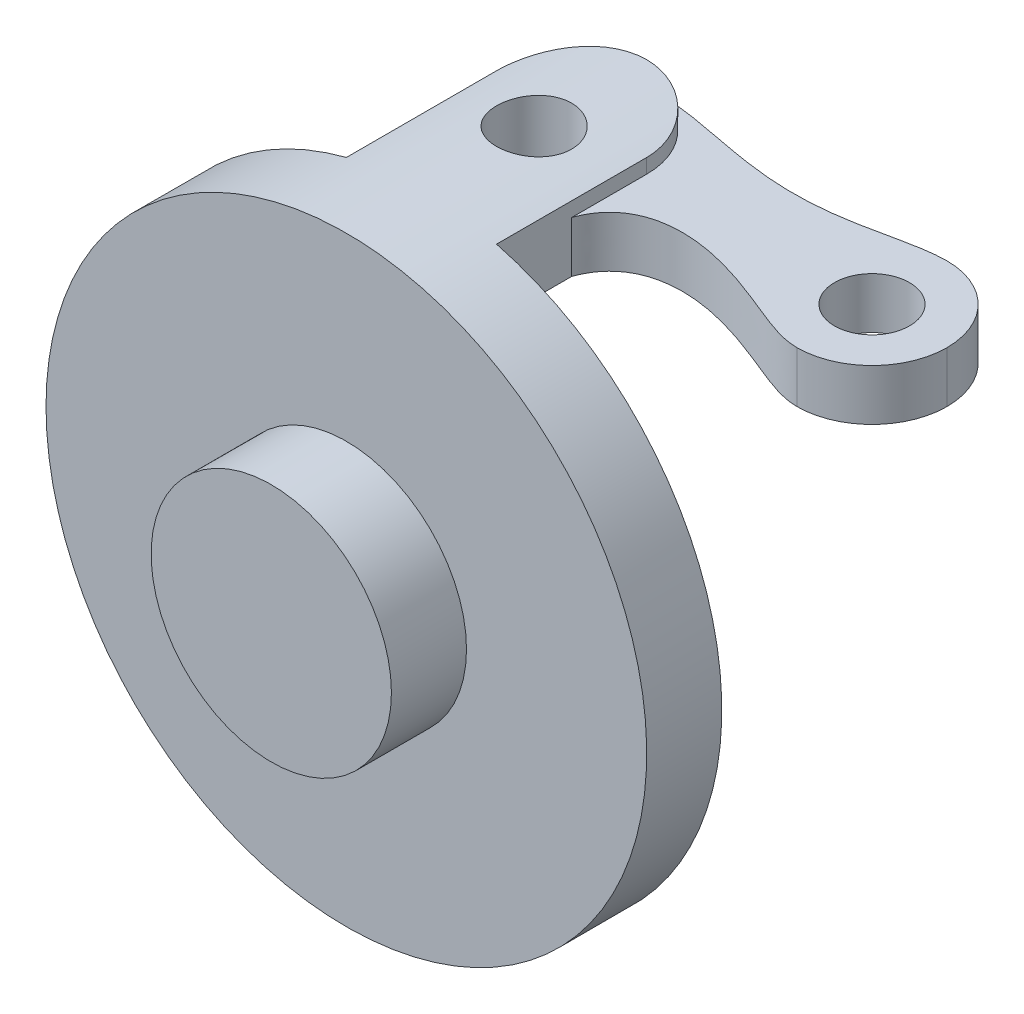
ISO-10303-21;
HEADER;
FILE_DESCRIPTION(('STEP AP214'),'2;1');
FILE_NAME('part.step','',(''),(''),'','','');
FILE_SCHEMA(('AUTOMOTIVE_DESIGN { 1 0 10303 214 1 1 1 1 }'));
ENDSEC;
DATA;
#1=APPLICATION_CONTEXT('core data for automotive mechanical design processes');
#2=APPLICATION_PROTOCOL_DEFINITION('international standard','automotive_design',2000,#1);
#3=PRODUCT_CONTEXT('',#1,'mechanical');
#4=PRODUCT('Part','Part','',(#3));
#5=PRODUCT_RELATED_PRODUCT_CATEGORY('part','',(#4));
#6=PRODUCT_DEFINITION_FORMATION('','',#4);
#7=PRODUCT_DEFINITION_CONTEXT('part definition',#1,'design');
#8=PRODUCT_DEFINITION('design','',#6,#7);
#9=PRODUCT_DEFINITION_SHAPE('','',#8);
#10=(LENGTH_UNIT() NAMED_UNIT(*) SI_UNIT(.MILLI.,.METRE.));
#11=(NAMED_UNIT(*) PLANE_ANGLE_UNIT() SI_UNIT($,.RADIAN.));
#12=(NAMED_UNIT(*) SI_UNIT($,.STERADIAN.) SOLID_ANGLE_UNIT());
#13=UNCERTAINTY_MEASURE_WITH_UNIT(LENGTH_MEASURE(1.E-05),#10,'distance_accuracy_value','');
#14=(GEOMETRIC_REPRESENTATION_CONTEXT(3) GLOBAL_UNCERTAINTY_ASSIGNED_CONTEXT((#13)) GLOBAL_UNIT_ASSIGNED_CONTEXT((#10,
#11,#12)) REPRESENTATION_CONTEXT('',''));
#15=CARTESIAN_POINT('',(0.,0.,0.));
#16=DIRECTION('',(0.,0.,1.));
#17=DIRECTION('',(1.,0.,0.));
#18=AXIS2_PLACEMENT_3D('',#15,#16,#17);
#19=CARTESIAN_POINT('',(0.,0.,-150.));
#20=DIRECTION('',(0.,1.,0.));
#21=DIRECTION('',(-1.,0.,0.));
#22=AXIS2_PLACEMENT_3D('',#19,#20,#21);
#23=CYLINDRICAL_SURFACE('',#22,50.);
#24=DIRECTION('',(0.,-1.,0.));
#25=VECTOR('',#24,1.);
#26=CARTESIAN_POINT('',(50.,193.649167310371,-150.));
#27=LINE('',#26,#25);
#28=CARTESIAN_POINT('',(50.,184.,-150.));
#29=VERTEX_POINT('',#28);
#30=CARTESIAN_POINT('',(50.,193.649167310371,-150.));
#31=VERTEX_POINT('',#30);
#32=EDGE_CURVE('E336',#29,#31,#27,.F.);
#33=ORIENTED_EDGE('',*,*,#32,.F.);
#34=CARTESIAN_POINT('',(0.,184.,-150.));
#35=DIRECTION('',(0.,-1.,0.));
#36=DIRECTION('',(0.,0.,-1.));
#37=AXIS2_PLACEMENT_3D('',#34,#35,#36);
#38=CIRCLE('',#37,50.);
#39=CARTESIAN_POINT('',(0.,184.,-200.));
#40=VERTEX_POINT('',#39);
#41=EDGE_CURVE('E335',#29,#40,#38,.F.);
#42=ORIENTED_EDGE('',*,*,#41,.T.);
#43=DIRECTION('',(0.,1.,0.));
#44=VECTOR('',#43,1.);
#45=CARTESIAN_POINT('',(0.,193.649167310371,-200.));
#46=LINE('',#45,#44);
#47=CARTESIAN_POINT('',(0.,200.,-200.));
#48=VERTEX_POINT('',#47);
#49=EDGE_CURVE('E283',#40,#48,#46,.T.);
#50=ORIENTED_EDGE('',*,*,#49,.T.);
#51=CARTESIAN_POINT('',(50.,193.649167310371,-150.));
#52=CARTESIAN_POINT('',(50.0000111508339,193.64915715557,-150.691382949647));
#53=CARTESIAN_POINT('',(49.9856601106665,193.652869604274,-151.382764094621));
#54=CARTESIAN_POINT('',(49.928314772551,193.667666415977,-152.764237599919));
#55=CARTESIAN_POINT('',(49.8853213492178,193.678750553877,-153.45432999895));
#56=CARTESIAN_POINT('',(49.7707818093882,193.708215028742,-154.831869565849));
#57=CARTESIAN_POINT('',(49.6992404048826,193.726594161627,-155.51931715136));
#58=CARTESIAN_POINT('',(49.5277609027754,193.770505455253,-156.890445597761));
#59=CARTESIAN_POINT('',(49.4278222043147,193.796037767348,-157.574126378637));
#60=CARTESIAN_POINT('',(49.1999912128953,193.85400340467,-158.935095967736));
#61=CARTESIAN_POINT('',(49.0721558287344,193.886422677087,-159.612394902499));
#62=CARTESIAN_POINT('',(48.7886937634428,193.957945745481,-160.960745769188));
#63=CARTESIAN_POINT('',(48.6330688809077,193.997049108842,-161.631798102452));
#64=CARTESIAN_POINT('',(48.2943508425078,194.081648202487,-162.966480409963));
#65=CARTESIAN_POINT('',(48.1112598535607,194.127143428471,-163.630110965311));
#66=CARTESIAN_POINT('',(47.7179446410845,194.224196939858,-164.948964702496));
#67=CARTESIAN_POINT('',(47.5077138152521,194.275756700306,-165.604185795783));
#68=CARTESIAN_POINT('',(46.8370875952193,194.438935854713,-167.554974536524));
#69=CARTESIAN_POINT('',(46.336599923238,194.559095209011,-168.836291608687));
#70=CARTESIAN_POINT('',(45.2326261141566,194.818712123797,-171.351727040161));
#71=CARTESIAN_POINT('',(44.6291375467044,194.958170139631,-172.58584428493));
#72=CARTESIAN_POINT('',(43.6500438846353,195.178854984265,-174.395589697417));
#73=CARTESIAN_POINT('',(43.3112571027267,195.254357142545,-174.992104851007));
#74=CARTESIAN_POINT('',(42.6097070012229,195.408653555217,-176.170263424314));
#75=CARTESIAN_POINT('',(42.2469498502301,195.487446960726,-176.751910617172));
#76=CARTESIAN_POINT('',(41.4979785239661,195.647807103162,-177.899594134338));
#77=CARTESIAN_POINT('',(41.1117619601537,195.729374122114,-178.465628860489));
#78=CARTESIAN_POINT('',(40.3165611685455,195.894716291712,-179.581147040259));
#79=CARTESIAN_POINT('',(39.9075753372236,195.978491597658,-180.130629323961));
#80=CARTESIAN_POINT('',(38.6309823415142,196.235599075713,-181.774137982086));
#81=CARTESIAN_POINT('',(37.7283141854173,196.411557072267,-182.840862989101));
#82=CARTESIAN_POINT('',(35.8371983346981,196.765394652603,-184.894765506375));
#83=CARTESIAN_POINT('',(34.8487491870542,196.94327426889,-185.881941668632));
#84=CARTESIAN_POINT('',(32.7922191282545,197.296119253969,-187.770617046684));
#85=CARTESIAN_POINT('',(31.7241229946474,197.471084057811,-188.672099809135));
#86=CARTESIAN_POINT('',(29.5154590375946,197.813261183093,-190.383030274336));
#87=CARTESIAN_POINT('',(28.3748919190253,197.980473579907,-191.192478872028));
#88=CARTESIAN_POINT('',(26.0119903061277,198.304862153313,-192.724548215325));
#89=CARTESIAN_POINT('',(24.7887227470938,198.461861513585,-193.445768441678));
#90=CARTESIAN_POINT('',(22.283538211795,198.758734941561,-194.782357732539));
#91=CARTESIAN_POINT('',(21.0016171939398,198.898607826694,-195.397719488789));
#92=CARTESIAN_POINT('',(18.3890845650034,199.157132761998,-196.51730983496));
#93=CARTESIAN_POINT('',(17.0585056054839,199.27579873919,-197.021611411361));
#94=CARTESIAN_POINT('',(14.3576092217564,199.488577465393,-197.915355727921));
#95=CARTESIAN_POINT('',(12.9873016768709,199.582696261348,-198.304826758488));
#96=CARTESIAN_POINT('',(10.6537271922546,199.718307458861,-198.861537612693));
#97=CARTESIAN_POINT('',(9.69823097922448,199.76703794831,-199.060134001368));
#98=CARTESIAN_POINT('',(7.77682501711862,199.851057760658,-199.401139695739));
#99=CARTESIAN_POINT('',(6.81091753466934,199.886349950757,-199.543560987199));
#100=CARTESIAN_POINT('',(4.87273178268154,199.942979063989,-199.771555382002));
#101=CARTESIAN_POINT('',(3.90045862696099,199.964326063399,-199.857169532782));
#102=CARTESIAN_POINT('',(1.95212979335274,199.992855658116,-199.971419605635));
#103=CARTESIAN_POINT('',(0.976073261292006,200.000034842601,-200.000041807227));
#104=CARTESIAN_POINT('',(0.,200.,-200.));
#105=B_SPLINE_CURVE_WITH_KNOTS('',3,(#51,#52,#53,#54,#55,#56,#57,#58,#59,#60,#61,#62,#63,#64,
#65,#66,#67,#68,#69,#70,#71,#72,#73,#74,#75,#76,#77,#78,#79,#80,#81,#82,#83,#84,#85,#86,#87,#88,
#89,#90,#91,#92,#93,#94,#95,#96,#97,#98,#99,#100,#101,#102,#103,#104),.UNSPECIFIED.,.F.,.F.,(4,
2,2,2,2,2,2,2,2,2,2,2,2,2,2,2,2,2,2,2,2,2,2,2,2,2,4),(0.,2.0739871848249,4.14791104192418,
6.2214927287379,8.29511829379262,10.3645525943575,12.4338530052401,14.502990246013,
16.5726317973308,20.7099859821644,24.8474378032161,26.9173990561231,28.9868296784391,
31.0564713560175,33.1262589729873,37.3462267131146,41.5662659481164,45.7871138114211,
50.0079206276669,54.2888299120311,58.5700346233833,62.8484173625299,67.1257451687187,
70.0555295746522,72.984688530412,75.9117286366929,78.8394733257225),.UNSPECIFIED.);
#106=EDGE_CURVE('E236',#31,#48,#105,.T.);
#107=ORIENTED_EDGE('',*,*,#106,.F.);
#108=EDGE_LOOP('',(#33,#42,#50,#107));
#109=FACE_BOUND('',#108,.T.);
#110=ADVANCED_FACE('F38',(#109),#23,.T.);
#111=CARTESIAN_POINT('',(0.,0.,-50.));
#112=DIRECTION('',(0.,0.,-1.));
#113=DIRECTION('',(-1.,0.,0.));
#114=AXIS2_PLACEMENT_3D('',#111,#112,#113);
#115=PLANE('',#114);
#116=DIRECTION('',(1.,0.,0.));
#117=VECTOR('',#116,1.);
#118=CARTESIAN_POINT('',(0.,-150.,-50.));
#119=LINE('',#118,#117);
#120=CARTESIAN_POINT('',(-50.,-150.,-50.));
#121=VERTEX_POINT('',#120);
#122=CARTESIAN_POINT('',(50.,-150.,-50.));
#123=VERTEX_POINT('',#122);
#124=EDGE_CURVE('E378',#121,#123,#119,.T.);
#125=ORIENTED_EDGE('',*,*,#124,.F.);
#126=DIRECTION('',(0.,1.,0.));
#127=VECTOR('',#126,1.);
#128=CARTESIAN_POINT('',(-50.,-150.,-50.));
#129=LINE('',#128,#127);
#130=CARTESIAN_POINT('',(-50.,-193.649167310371,-50.));
#131=VERTEX_POINT('',#130);
#132=EDGE_CURVE('E368',#131,#121,#129,.T.);
#133=ORIENTED_EDGE('',*,*,#132,.F.);
#134=CARTESIAN_POINT('',(0.,0.,-50.));
#135=DIRECTION('',(0.,0.,-1.));
#136=DIRECTION('',(-1.,0.,0.));
#137=AXIS2_PLACEMENT_3D('',#134,#135,#136);
#138=CIRCLE('',#137,200.);
#139=CARTESIAN_POINT('',(-50.,193.649167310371,-50.));
#140=VERTEX_POINT('',#139);
#141=EDGE_CURVE('E399',#131,#140,#138,.T.);
#142=ORIENTED_EDGE('',*,*,#141,.T.);
#143=DIRECTION('',(0.,1.,0.));
#144=VECTOR('',#143,1.);
#145=CARTESIAN_POINT('',(-50.,150.,-50.));
#146=LINE('',#145,#144);
#147=CARTESIAN_POINT('',(-50.,150.,-50.));
#148=VERTEX_POINT('',#147);
#149=EDGE_CURVE('E381',#148,#140,#146,.T.);
#150=ORIENTED_EDGE('',*,*,#149,.F.);
#151=DIRECTION('',(-1.,0.,0.));
#152=VECTOR('',#151,1.);
#153=CARTESIAN_POINT('',(0.,150.,-50.));
#154=LINE('',#153,#152);
#155=CARTESIAN_POINT('',(50.,150.,-50.));
#156=VERTEX_POINT('',#155);
#157=EDGE_CURVE('E387',#156,#148,#154,.T.);
#158=ORIENTED_EDGE('',*,*,#157,.F.);
#159=DIRECTION('',(0.,-1.,0.));
#160=VECTOR('',#159,1.);
#161=CARTESIAN_POINT('',(50.,150.,-50.));
#162=LINE('',#161,#160);
#163=CARTESIAN_POINT('',(50.,193.649167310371,-50.));
#164=VERTEX_POINT('',#163);
#165=EDGE_CURVE('E384',#164,#156,#162,.T.);
#166=ORIENTED_EDGE('',*,*,#165,.F.);
#167=CARTESIAN_POINT('',(50.,-193.649167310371,-50.));
#168=VERTEX_POINT('',#167);
#169=EDGE_CURVE('E396',#164,#168,#138,.T.);
#170=ORIENTED_EDGE('',*,*,#169,.T.);
#171=DIRECTION('',(0.,-1.,0.));
#172=VECTOR('',#171,1.);
#173=CARTESIAN_POINT('',(50.,-150.,-50.));
#174=LINE('',#173,#172);
#175=EDGE_CURVE('E375',#123,#168,#174,.T.);
#176=ORIENTED_EDGE('',*,*,#175,.F.);
#177=EDGE_LOOP('',(#125,#133,#142,#150,#158,#166,#170,#176));
#178=FACE_BOUND('',#177,.T.);
#179=ADVANCED_FACE('F263',(#178),#115,.T.);
#180=CARTESIAN_POINT('',(0.,0.,50.));
#181=DIRECTION('',(0.,0.,-1.));
#182=DIRECTION('',(-1.,0.,0.));
#183=AXIS2_PLACEMENT_3D('',#180,#181,#182);
#184=CYLINDRICAL_SURFACE('',#183,80.);
#185=CARTESIAN_POINT('',(0.,0.,50.));
#186=DIRECTION('',(0.,0.,1.));
#187=DIRECTION('',(1.,0.,0.));
#188=AXIS2_PLACEMENT_3D('',#185,#186,#187);
#189=CIRCLE('',#188,80.);
#190=CARTESIAN_POINT('',(80.,0.,50.));
#191=VERTEX_POINT('',#190);
#192=EDGE_CURVE('E309',#191,#191,#189,.T.);
#193=ORIENTED_EDGE('',*,*,#192,.F.);
#194=EDGE_LOOP('',(#193));
#195=FACE_BOUND('',#194,.T.);
#196=CARTESIAN_POINT('',(0.,0.,0.));
#197=DIRECTION('',(0.,0.,1.));
#198=DIRECTION('',(1.,0.,0.));
#199=AXIS2_PLACEMENT_3D('',#196,#197,#198);
#200=CIRCLE('',#199,80.);
#201=CARTESIAN_POINT('',(80.,0.,0.));
#202=VERTEX_POINT('',#201);
#203=EDGE_CURVE('E304',#202,#202,#200,.T.);
#204=ORIENTED_EDGE('',*,*,#203,.T.);
#205=EDGE_LOOP('',(#204));
#206=FACE_BOUND('',#205,.T.);
#207=ADVANCED_FACE('F407',(#195,#206),#184,.T.);
#208=CARTESIAN_POINT('',(0.,0.,50.));
#209=DIRECTION('',(0.,0.,1.));
#210=DIRECTION('',(1.,0.,0.));
#211=AXIS2_PLACEMENT_3D('',#208,#209,#210);
#212=PLANE('',#211);
#213=ORIENTED_EDGE('',*,*,#192,.T.);
#214=EDGE_LOOP('',(#213));
#215=FACE_BOUND('',#214,.T.);
#216=ADVANCED_FACE('F217',(#215),#212,.T.);
#217=CARTESIAN_POINT('',(0.,0.,-50.));
#218=DIRECTION('',(0.,0.,1.));
#219=DIRECTION('',(1.,0.,0.));
#220=AXIS2_PLACEMENT_3D('',#217,#218,#219);
#221=CYLINDRICAL_SURFACE('',#220,200.);
#222=CARTESIAN_POINT('',(0.,200.,-150.));
#223=CARTESIAN_POINT('',(0.699450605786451,200.000002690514,-150.000008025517));
#224=CARTESIAN_POINT('',(1.39878337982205,199.996323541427,-149.970635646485));
#225=CARTESIAN_POINT('',(2.79267071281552,199.981715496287,-149.85337174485));
#226=CARTESIAN_POINT('',(3.48722415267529,199.970784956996,-149.765466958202));
#227=CARTESIAN_POINT('',(4.86701884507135,199.941963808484,-149.531658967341));
#228=CARTESIAN_POINT('',(5.55225054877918,199.924066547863,-149.385700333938));
#229=CARTESIAN_POINT('',(6.90783145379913,199.881819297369,-149.036880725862));
#230=CARTESIAN_POINT('',(7.57818149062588,199.857469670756,-148.834022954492));
#231=CARTESIAN_POINT('',(8.89886079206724,199.803020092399,-148.37304301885));
#232=CARTESIAN_POINT('',(9.549202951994,199.772923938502,-148.114957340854));
#233=CARTESIAN_POINT('',(10.8257809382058,199.707814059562,-147.545310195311));
#234=CARTESIAN_POINT('',(11.4520164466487,199.67280026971,-147.233748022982));
#235=CARTESIAN_POINT('',(12.6759006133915,199.598841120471,-146.559443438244));
#236=CARTESIAN_POINT('',(13.273554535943,199.559896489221,-146.196710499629));
#237=CARTESIAN_POINT('',(14.4362651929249,199.479156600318,-145.422586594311));
#238=CARTESIAN_POINT('',(15.0013218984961,199.437361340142,-145.011195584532));
#239=CARTESIAN_POINT('',(16.0976345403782,199.35187486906,-144.140495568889));
#240=CARTESIAN_POINT('',(16.6287106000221,199.308175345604,-143.680960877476));
#241=CARTESIAN_POINT('',(17.6503167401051,199.220303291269,-142.718878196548));
#242=CARTESIAN_POINT('',(18.1408466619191,199.176130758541,-142.216330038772));
#243=CARTESIAN_POINT('',(19.0779606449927,199.088555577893,-141.171697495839));
#244=CARTESIAN_POINT('',(19.5245425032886,199.045152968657,-140.629611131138));
#245=CARTESIAN_POINT('',(20.3705972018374,198.960346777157,-139.50969589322));
#246=CARTESIAN_POINT('',(20.770070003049,198.91894319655,-138.931866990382));
#247=CARTESIAN_POINT('',(21.5203421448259,198.839175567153,-137.742484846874));
#248=CARTESIAN_POINT('',(21.8709726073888,198.800822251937,-137.130824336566));
#249=CARTESIAN_POINT('',(22.5194278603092,198.728412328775,-135.879876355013));
#250=CARTESIAN_POINT('',(22.8172524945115,198.694355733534,-135.240588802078));
#251=CARTESIAN_POINT('',(23.3579117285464,198.631523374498,-133.938936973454));
#252=CARTESIAN_POINT('',(23.6007479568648,198.602747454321,-133.276573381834));
#253=CARTESIAN_POINT('',(24.0296440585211,198.551310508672,-131.933481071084));
#254=CARTESIAN_POINT('',(24.2157042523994,198.528649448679,-131.252752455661));
#255=CARTESIAN_POINT('',(24.5288362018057,198.490203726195,-129.881419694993));
#256=CARTESIAN_POINT('',(24.6562113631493,198.474383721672,-129.190885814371));
#257=CARTESIAN_POINT('',(24.8524500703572,198.449906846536,-127.801427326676));
#258=CARTESIAN_POINT('',(24.9213137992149,198.441249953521,-127.102502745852));
#259=CARTESIAN_POINT('',(25.0000106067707,198.431350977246,-125.70131064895));
#260=CARTESIAN_POINT('',(25.0098457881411,198.43010862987,-124.99904325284));
#261=CARTESIAN_POINT('',(24.9704168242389,198.435074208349,-123.596197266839));
#262=CARTESIAN_POINT('',(24.9211528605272,198.441282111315,-122.895618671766));
#263=CARTESIAN_POINT('',(24.764347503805,198.460911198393,-121.505178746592));
#264=CARTESIAN_POINT('',(24.6571409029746,198.474290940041,-120.815279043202));
#265=CARTESIAN_POINT('',(24.3854650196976,198.507853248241,-119.447020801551));
#266=CARTESIAN_POINT('',(24.2209959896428,198.528035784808,-118.768662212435));
#267=CARTESIAN_POINT('',(23.8360005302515,198.574627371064,-117.428255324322));
#268=CARTESIAN_POINT('',(23.6154733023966,198.601036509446,-116.766207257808));
#269=CARTESIAN_POINT('',(23.1199645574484,198.659330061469,-115.463062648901));
#270=CARTESIAN_POINT('',(22.8449828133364,198.691214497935,-114.821966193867));
#271=CARTESIAN_POINT('',(22.2417069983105,198.759650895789,-113.563446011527));
#272=CARTESIAN_POINT('',(21.9132678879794,198.796215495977,-112.946092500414));
#273=CARTESIAN_POINT('',(21.2059601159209,198.87290849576,-111.741219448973));
#274=CARTESIAN_POINT('',(20.8270913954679,198.913036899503,-111.153699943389));
#275=CARTESIAN_POINT('',(20.0215771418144,198.995729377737,-110.012530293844));
#276=CARTESIAN_POINT('',(19.5949297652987,199.038293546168,-109.458881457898));
#277=CARTESIAN_POINT('',(18.6968447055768,199.124663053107,-108.389291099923));
#278=CARTESIAN_POINT('',(18.2254068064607,199.168468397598,-107.87334975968));
#279=CARTESIAN_POINT('',(17.2375949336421,199.256399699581,-106.879302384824));
#280=CARTESIAN_POINT('',(16.7209325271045,199.300525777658,-106.401482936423));
#281=CARTESIAN_POINT('',(15.6491148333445,199.387547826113,-105.491037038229));
#282=CARTESIAN_POINT('',(15.0939593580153,199.43044379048,-105.058410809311));
#283=CARTESIAN_POINT('',(13.9490321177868,199.51379372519,-104.241409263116));
#284=CARTESIAN_POINT('',(13.3592601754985,199.554247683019,-103.857034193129));
#285=CARTESIAN_POINT('',(12.1492344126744,199.631569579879,-103.139283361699));
#286=CARTESIAN_POINT('',(11.5289806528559,199.668437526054,-102.805907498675));
#287=CARTESIAN_POINT('',(10.2621376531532,199.737555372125,-102.192457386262));
#288=CARTESIAN_POINT('',(9.6155394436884,199.769803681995,-101.912401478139));
#289=CARTESIAN_POINT('',(8.30079054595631,199.828751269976,-101.407783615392));
#290=CARTESIAN_POINT('',(7.63263983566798,199.855450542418,-101.183221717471));
#291=CARTESIAN_POINT('',(6.27958404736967,199.902538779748,-100.791263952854));
#292=CARTESIAN_POINT('',(5.59467961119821,199.922927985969,-100.623865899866));
#293=CARTESIAN_POINT('',(4.21301808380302,199.956815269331,-100.347478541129));
#294=CARTESIAN_POINT('',(3.51626106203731,199.970313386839,-100.23848889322));
#295=CARTESIAN_POINT('',(2.12061214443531,199.989966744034,-100.080270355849));
#296=CARTESIAN_POINT('',(1.42176562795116,199.996170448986,-100.030646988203));
#297=CARTESIAN_POINT('',(0.0223481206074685,200.001222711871,-99.9902120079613));
#298=CARTESIAN_POINT('',(-0.678222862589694,200.000071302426,-99.9994001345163));
#299=CARTESIAN_POINT('',(-2.07605816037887,199.990446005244,-100.076518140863));
#300=CARTESIAN_POINT('',(-2.77332254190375,199.981972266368,-100.144446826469));
#301=CARTESIAN_POINT('',(-4.159573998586,199.957941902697,-100.338536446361));
#302=CARTESIAN_POINT('',(-4.84856107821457,199.942385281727,-100.464697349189));
#303=CARTESIAN_POINT('',(-6.21109960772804,199.904690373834,-100.773802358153));
#304=CARTESIAN_POINT('',(-6.88469444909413,199.882573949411,-100.956557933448));
#305=CARTESIAN_POINT('',(-8.214048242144,199.832359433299,-101.377647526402));
#306=CARTESIAN_POINT('',(-8.86980724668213,199.804261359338,-101.615981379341));
#307=CARTESIAN_POINT('',(-10.1589280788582,199.742866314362,-102.146509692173));
#308=CARTESIAN_POINT('',(-10.7922893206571,199.709569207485,-102.438705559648));
#309=CARTESIAN_POINT('',(-12.0322068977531,199.638702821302,-103.074865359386));
#310=CARTESIAN_POINT('',(-12.6387630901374,199.601133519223,-103.418829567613));
#311=CARTESIAN_POINT('',(-13.8239377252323,199.522563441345,-104.157998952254));
#312=CARTESIAN_POINT('',(-14.4023959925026,199.48154597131,-104.553459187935));
#313=CARTESIAN_POINT('',(-15.5239937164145,199.397397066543,-105.391438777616));
#314=CARTESIAN_POINT('',(-16.0671330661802,199.354265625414,-105.833958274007));
#315=CARTESIAN_POINT('',(-17.1143512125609,199.267094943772,-106.762979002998));
#316=CARTESIAN_POINT('',(-17.618428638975,199.223055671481,-107.249481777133));
#317=CARTESIAN_POINT('',(-18.5840074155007,199.135305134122,-108.263076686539));
#318=CARTESIAN_POINT('',(-19.0455086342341,199.091593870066,-108.79016894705));
#319=CARTESIAN_POINT('',(-19.9252216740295,199.005482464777,-109.884406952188));
#320=CARTESIAN_POINT('',(-20.3431716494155,198.963091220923,-110.451763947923));
#321=CARTESIAN_POINT('',(-21.1297863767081,198.881091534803,-111.61986781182));
#322=CARTESIAN_POINT('',(-21.4984509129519,198.841483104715,-112.220614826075));
#323=CARTESIAN_POINT('',(-22.1838415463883,198.766184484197,-113.451267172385));
#324=CARTESIAN_POINT('',(-22.500568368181,198.730494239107,-114.081172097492));
#325=CARTESIAN_POINT('',(-23.0797861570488,198.664059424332,-115.365694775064));
#326=CARTESIAN_POINT('',(-23.3422773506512,198.633314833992,-116.020312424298));
#327=CARTESIAN_POINT('',(-23.8104776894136,198.577734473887,-117.347859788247));
#328=CARTESIAN_POINT('',(-24.0163339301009,198.552883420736,-118.020736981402));
#329=CARTESIAN_POINT('',(-24.370647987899,198.50970607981,-119.381644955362));
#330=CARTESIAN_POINT('',(-24.5191058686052,198.491379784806,-120.069675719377));
#331=CARTESIAN_POINT('',(-24.757506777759,198.461785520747,-121.455924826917));
#332=CARTESIAN_POINT('',(-24.8474520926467,198.450517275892,-122.154142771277));
#333=CARTESIAN_POINT('',(-24.9681580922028,198.435366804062,-123.555754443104));
#334=CARTESIAN_POINT('',(-24.9989190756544,198.431484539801,-124.259148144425));
#335=CARTESIAN_POINT('',(-25.0010176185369,198.431220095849,-125.661137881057));
#336=CARTESIAN_POINT('',(-24.9727661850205,198.434786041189,-126.359733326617));
#337=CARTESIAN_POINT('',(-24.8578811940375,198.44921033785,-127.752028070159));
#338=CARTESIAN_POINT('',(-24.7712479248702,198.460068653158,-128.445727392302));
#339=CARTESIAN_POINT('',(-24.5402444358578,198.488765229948,-129.823294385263));
#340=CARTESIAN_POINT('',(-24.3958743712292,198.506603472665,-130.507162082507));
#341=CARTESIAN_POINT('',(-24.0504636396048,198.548748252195,-131.860227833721));
#342=CARTESIAN_POINT('',(-23.8494228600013,198.57305480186,-132.529425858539));
#343=CARTESIAN_POINT('',(-23.3922252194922,198.627431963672,-133.848201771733));
#344=CARTESIAN_POINT('',(-23.136088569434,198.65750046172,-134.497786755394));
#345=CARTESIAN_POINT('',(-22.5705062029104,198.722553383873,-135.773059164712));
#346=CARTESIAN_POINT('',(-22.2610605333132,198.757537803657,-136.398746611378));
#347=CARTESIAN_POINT('',(-21.5910652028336,198.831434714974,-137.621891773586));
#348=CARTESIAN_POINT('',(-21.2305153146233,198.870347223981,-138.219349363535));
#349=CARTESIAN_POINT('',(-20.4608520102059,198.951007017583,-139.381916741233));
#350=CARTESIAN_POINT('',(-20.0517383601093,198.992754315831,-139.947026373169));
#351=CARTESIAN_POINT('',(-19.1849128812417,199.078200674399,-141.04466962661));
#352=CARTESIAN_POINT('',(-18.7268948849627,199.12191090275,-141.57696062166));
#353=CARTESIAN_POINT('',(-17.7677397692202,199.209787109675,-142.601126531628));
#354=CARTESIAN_POINT('',(-17.2666023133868,199.253953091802,-143.093001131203));
#355=CARTESIAN_POINT('',(-16.2245766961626,199.341507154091,-144.033013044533));
#356=CARTESIAN_POINT('',(-15.683679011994,199.384895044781,-144.481139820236));
#357=CARTESIAN_POINT('',(-14.5660116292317,199.469660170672,-145.33036876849));
#358=CARTESIAN_POINT('',(-13.9892424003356,199.511037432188,-145.731471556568));
#359=CARTESIAN_POINT('',(-12.8015926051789,199.590768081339,-146.485245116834));
#360=CARTESIAN_POINT('',(-12.1905910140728,199.629109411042,-146.837726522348));
#361=CARTESIAN_POINT('',(-10.9407586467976,199.701506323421,-147.489924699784));
#362=CARTESIAN_POINT('',(-10.3019261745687,199.735561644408,-147.789638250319));
#363=CARTESIAN_POINT('',(-9.00162635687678,199.798382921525,-148.333814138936));
#364=CARTESIAN_POINT('',(-8.34018222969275,199.827154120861,-148.57833130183));
#365=CARTESIAN_POINT('',(-6.99901010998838,199.878624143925,-149.010629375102));
#366=CARTESIAN_POINT('',(-6.31928647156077,199.901324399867,-149.1984236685));
#367=CARTESIAN_POINT('',(-4.71044173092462,199.946646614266,-149.570452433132));
#368=CARTESIAN_POINT('',(-3.77575448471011,199.966570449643,-149.731366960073));
#369=CARTESIAN_POINT('',(-1.8939727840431,199.993245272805,-149.946134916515));
#370=CARTESIAN_POINT('',(-0.946878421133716,199.999996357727,-149.999989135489));
#371=CARTESIAN_POINT('',(0.,200.,-150.));
#372=B_SPLINE_CURVE_WITH_KNOTS('',3,(#222,#223,#224,#225,#226,#227,#228,#229,#230,#231,#232,
#233,#234,#235,#236,#237,#238,#239,#240,#241,#242,#243,#244,#245,#246,#247,#248,#249,#250,#251,
#252,#253,#254,#255,#256,#257,#258,#259,#260,#261,#262,#263,#264,#265,#266,#267,#268,#269,#270,
#271,#272,#273,#274,#275,#276,#277,#278,#279,#280,#281,#282,#283,#284,#285,#286,#287,#288,#289,
#290,#291,#292,#293,#294,#295,#296,#297,#298,#299,#300,#301,#302,#303,#304,#305,#306,#307,#308,
#309,#310,#311,#312,#313,#314,#315,#316,#317,#318,#319,#320,#321,#322,#323,#324,#325,#326,#327,
#328,#329,#330,#331,#332,#333,#334,#335,#336,#337,#338,#339,#340,#341,#342,#343,#344,#345,#346,
#347,#348,#349,#350,#351,#352,#353,#354,#355,#356,#357,#358,#359,#360,#361,#362,#363,#364,#365,
#366,#367,#368,#369,#370,#371),.UNSPECIFIED.,.T.,.F.,(4,2,2,2,2,2,2,2,2,2,2,2,2,2,2,2,2,2,2,2,2,
2,2,2,2,2,2,2,2,2,2,2,2,2,2,2,2,2,2,2,2,2,2,2,2,2,2,2,2,2,2,2,2,2,2,2,2,2,2,2,2,2,2,2,2,2,2,2,2,
2,2,2,2,2,4),(0.,2.09752318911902,4.19552186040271,6.29552850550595,8.39541694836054,
10.4939223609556,12.5924554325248,14.6906004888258,16.7887474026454,18.8972118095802,
21.0056844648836,23.1142627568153,25.2228427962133,27.3385415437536,29.4542465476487,
31.5698888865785,33.6855192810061,35.7900854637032,37.8946450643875,39.999129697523,
42.1036078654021,44.196054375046,46.2884916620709,48.3809587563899,50.4734345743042,
52.5716853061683,54.6699384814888,56.7682726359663,58.8666169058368,60.9794844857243,
63.0923623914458,65.2052511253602,67.3181356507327,69.4317456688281,71.5453578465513,
73.6588891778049,75.7724081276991,77.8718037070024,79.9711899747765,82.0705335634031,
84.1698760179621,86.2622989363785,88.354715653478,90.4471870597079,92.5396696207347,
94.642941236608,96.7462192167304,98.8495709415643,100.952929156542,103.06828092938,
105.183641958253,107.298973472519,109.414296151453,111.524071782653,113.633845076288,
115.743535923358,117.853216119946,119.948251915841,122.043277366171,124.138297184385,
126.233321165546,128.327577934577,130.421832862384,132.516097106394,134.610371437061,
136.718625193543,138.826895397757,140.935672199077,143.044421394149,145.161164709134,
147.278037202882,149.392797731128,151.507058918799,154.346593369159,157.18610688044),.UNSPECIFIED.);
#373=CARTESIAN_POINT('',(0.,200.,-150.));
#374=VERTEX_POINT('',#373);
#375=EDGE_CURVE('E203',#374,#374,#372,.T.);
#376=ORIENTED_EDGE('',*,*,#375,.T.);
#377=EDGE_LOOP('',(#376));
#378=FACE_BOUND('',#377,.T.);
#379=CARTESIAN_POINT('',(0.,-200.,-150.));
#380=CARTESIAN_POINT('',(-0.699450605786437,-200.000002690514,-150.000008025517));
#381=CARTESIAN_POINT('',(-1.39878337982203,-199.996323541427,-149.970635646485));
#382=CARTESIAN_POINT('',(-2.7926707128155,-199.981715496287,-149.85337174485));
#383=CARTESIAN_POINT('',(-3.48722415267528,-199.970784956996,-149.765466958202));
#384=CARTESIAN_POINT('',(-4.86701884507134,-199.941963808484,-149.531658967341));
#385=CARTESIAN_POINT('',(-5.55225054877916,-199.924066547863,-149.385700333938));
#386=CARTESIAN_POINT('',(-6.90783145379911,-199.881819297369,-149.036880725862));
#387=CARTESIAN_POINT('',(-7.57818149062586,-199.857469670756,-148.834022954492));
#388=CARTESIAN_POINT('',(-8.89886079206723,-199.803020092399,-148.37304301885));
#389=CARTESIAN_POINT('',(-9.54920295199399,-199.772923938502,-148.114957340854));
#390=CARTESIAN_POINT('',(-10.8257809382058,-199.707814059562,-147.545310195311));
#391=CARTESIAN_POINT('',(-11.4520164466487,-199.67280026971,-147.233748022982));
#392=CARTESIAN_POINT('',(-12.6759006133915,-199.598841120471,-146.559443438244));
#393=CARTESIAN_POINT('',(-13.273554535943,-199.559896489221,-146.196710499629));
#394=CARTESIAN_POINT('',(-14.4362651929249,-199.479156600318,-145.422586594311));
#395=CARTESIAN_POINT('',(-15.0013218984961,-199.437361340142,-145.011195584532));
#396=CARTESIAN_POINT('',(-16.0976345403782,-199.35187486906,-144.140495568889));
#397=CARTESIAN_POINT('',(-16.6287106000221,-199.308175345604,-143.680960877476));
#398=CARTESIAN_POINT('',(-17.6503167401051,-199.220303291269,-142.718878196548));
#399=CARTESIAN_POINT('',(-18.1408466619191,-199.176130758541,-142.216330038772));
#400=CARTESIAN_POINT('',(-19.0779606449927,-199.088555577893,-141.171697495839));
#401=CARTESIAN_POINT('',(-19.5245425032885,-199.045152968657,-140.629611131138));
#402=CARTESIAN_POINT('',(-20.3705972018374,-198.960346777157,-139.50969589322));
#403=CARTESIAN_POINT('',(-20.7700700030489,-198.91894319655,-138.931866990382));
#404=CARTESIAN_POINT('',(-21.5203421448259,-198.839175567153,-137.742484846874));
#405=CARTESIAN_POINT('',(-21.8709726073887,-198.800822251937,-137.130824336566));
#406=CARTESIAN_POINT('',(-22.5194278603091,-198.728412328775,-135.879876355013));
#407=CARTESIAN_POINT('',(-22.8172524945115,-198.694355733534,-135.240588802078));
#408=CARTESIAN_POINT('',(-23.3579117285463,-198.631523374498,-133.938936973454));
#409=CARTESIAN_POINT('',(-23.6007479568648,-198.602747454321,-133.276573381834));
#410=CARTESIAN_POINT('',(-24.0296440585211,-198.551310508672,-131.933481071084));
#411=CARTESIAN_POINT('',(-24.2157042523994,-198.528649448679,-131.252752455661));
#412=CARTESIAN_POINT('',(-24.5288362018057,-198.490203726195,-129.881419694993));
#413=CARTESIAN_POINT('',(-24.6562113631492,-198.474383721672,-129.190885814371));
#414=CARTESIAN_POINT('',(-24.8524500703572,-198.449906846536,-127.801427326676));
#415=CARTESIAN_POINT('',(-24.9213137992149,-198.441249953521,-127.102502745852));
#416=CARTESIAN_POINT('',(-25.0000106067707,-198.431350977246,-125.70131064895));
#417=CARTESIAN_POINT('',(-25.0098457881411,-198.43010862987,-124.99904325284));
#418=CARTESIAN_POINT('',(-24.9704168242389,-198.435074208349,-123.596197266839));
#419=CARTESIAN_POINT('',(-24.9211528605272,-198.441282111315,-122.895618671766));
#420=CARTESIAN_POINT('',(-24.764347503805,-198.460911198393,-121.505178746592));
#421=CARTESIAN_POINT('',(-24.6571409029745,-198.474290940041,-120.815279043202));
#422=CARTESIAN_POINT('',(-24.3854650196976,-198.507853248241,-119.447020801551));
#423=CARTESIAN_POINT('',(-24.2209959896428,-198.528035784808,-118.768662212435));
#424=CARTESIAN_POINT('',(-23.8360005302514,-198.574627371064,-117.428255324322));
#425=CARTESIAN_POINT('',(-23.6154733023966,-198.601036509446,-116.766207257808));
#426=CARTESIAN_POINT('',(-23.1199645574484,-198.659330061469,-115.463062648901));
#427=CARTESIAN_POINT('',(-22.8449828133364,-198.691214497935,-114.821966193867));
#428=CARTESIAN_POINT('',(-22.2417069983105,-198.759650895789,-113.563446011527));
#429=CARTESIAN_POINT('',(-21.9132678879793,-198.796215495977,-112.946092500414));
#430=CARTESIAN_POINT('',(-21.2059601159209,-198.87290849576,-111.741219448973));
#431=CARTESIAN_POINT('',(-20.8270913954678,-198.913036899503,-111.153699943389));
#432=CARTESIAN_POINT('',(-20.0215771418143,-198.995729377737,-110.012530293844));
#433=CARTESIAN_POINT('',(-19.5949297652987,-199.038293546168,-109.458881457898));
#434=CARTESIAN_POINT('',(-18.6968447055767,-199.124663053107,-108.389291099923));
#435=CARTESIAN_POINT('',(-18.2254068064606,-199.168468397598,-107.87334975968));
#436=CARTESIAN_POINT('',(-17.2375949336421,-199.256399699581,-106.879302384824));
#437=CARTESIAN_POINT('',(-16.7209325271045,-199.300525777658,-106.401482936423));
#438=CARTESIAN_POINT('',(-15.6491148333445,-199.387547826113,-105.491037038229));
#439=CARTESIAN_POINT('',(-15.0939593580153,-199.43044379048,-105.058410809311));
#440=CARTESIAN_POINT('',(-13.9490321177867,-199.51379372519,-104.241409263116));
#441=CARTESIAN_POINT('',(-13.3592601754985,-199.554247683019,-103.857034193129));
#442=CARTESIAN_POINT('',(-12.1492344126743,-199.631569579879,-103.139283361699));
#443=CARTESIAN_POINT('',(-11.5289806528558,-199.668437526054,-102.805907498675));
#444=CARTESIAN_POINT('',(-10.2621376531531,-199.737555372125,-102.192457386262));
#445=CARTESIAN_POINT('',(-9.61553944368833,-199.769803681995,-101.912401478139));
#446=CARTESIAN_POINT('',(-8.30079054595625,-199.828751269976,-101.407783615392));
#447=CARTESIAN_POINT('',(-7.63263983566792,-199.855450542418,-101.183221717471));
#448=CARTESIAN_POINT('',(-6.27958404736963,-199.902538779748,-100.791263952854));
#449=CARTESIAN_POINT('',(-5.59467961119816,-199.922927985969,-100.623865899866));
#450=CARTESIAN_POINT('',(-4.21301808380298,-199.956815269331,-100.347478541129));
#451=CARTESIAN_POINT('',(-3.51626106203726,-199.970313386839,-100.23848889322));
#452=CARTESIAN_POINT('',(-2.12061214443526,-199.989966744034,-100.080270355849));
#453=CARTESIAN_POINT('',(-1.42176562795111,-199.996170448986,-100.030646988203));
#454=CARTESIAN_POINT('',(-0.0223481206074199,-200.001222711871,-99.9902120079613));
#455=CARTESIAN_POINT('',(0.678222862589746,-200.000071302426,-99.9994001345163));
#456=CARTESIAN_POINT('',(2.07605816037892,-199.990446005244,-100.076518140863));
#457=CARTESIAN_POINT('',(2.7733225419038,-199.981972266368,-100.144446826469));
#458=CARTESIAN_POINT('',(4.15957399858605,-199.957941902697,-100.338536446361));
#459=CARTESIAN_POINT('',(4.84856107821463,-199.942385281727,-100.464697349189));
#460=CARTESIAN_POINT('',(6.21109960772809,-199.904690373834,-100.773802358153));
#461=CARTESIAN_POINT('',(6.88469444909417,-199.882573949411,-100.956557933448));
#462=CARTESIAN_POINT('',(8.21404824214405,-199.832359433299,-101.377647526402));
#463=CARTESIAN_POINT('',(8.86980724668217,-199.804261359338,-101.615981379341));
#464=CARTESIAN_POINT('',(10.1589280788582,-199.742866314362,-102.146509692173));
#465=CARTESIAN_POINT('',(10.7922893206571,-199.709569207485,-102.438705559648));
#466=CARTESIAN_POINT('',(12.0322068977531,-199.638702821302,-103.074865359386));
#467=CARTESIAN_POINT('',(12.6387630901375,-199.601133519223,-103.418829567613));
#468=CARTESIAN_POINT('',(13.8239377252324,-199.522563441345,-104.157998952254));
#469=CARTESIAN_POINT('',(14.4023959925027,-199.48154597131,-104.553459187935));
#470=CARTESIAN_POINT('',(15.5239937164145,-199.397397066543,-105.391438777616));
#471=CARTESIAN_POINT('',(16.0671330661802,-199.354265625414,-105.833958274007));
#472=CARTESIAN_POINT('',(17.114351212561,-199.267094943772,-106.762979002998));
#473=CARTESIAN_POINT('',(17.618428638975,-199.223055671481,-107.249481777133));
#474=CARTESIAN_POINT('',(18.5840074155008,-199.135305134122,-108.263076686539));
#475=CARTESIAN_POINT('',(19.0455086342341,-199.091593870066,-108.79016894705));
#476=CARTESIAN_POINT('',(19.9252216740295,-199.005482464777,-109.884406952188));
#477=CARTESIAN_POINT('',(20.3431716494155,-198.963091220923,-110.451763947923));
#478=CARTESIAN_POINT('',(21.1297863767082,-198.881091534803,-111.61986781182));
#479=CARTESIAN_POINT('',(21.4984509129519,-198.841483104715,-112.220614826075));
#480=CARTESIAN_POINT('',(22.1838415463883,-198.766184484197,-113.451267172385));
#481=CARTESIAN_POINT('',(22.500568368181,-198.730494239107,-114.081172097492));
#482=CARTESIAN_POINT('',(23.0797861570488,-198.664059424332,-115.365694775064));
#483=CARTESIAN_POINT('',(23.3422773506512,-198.633314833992,-116.020312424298));
#484=CARTESIAN_POINT('',(23.8104776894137,-198.577734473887,-117.347859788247));
#485=CARTESIAN_POINT('',(24.016333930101,-198.552883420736,-118.020736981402));
#486=CARTESIAN_POINT('',(24.370647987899,-198.50970607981,-119.381644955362));
#487=CARTESIAN_POINT('',(24.5191058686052,-198.491379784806,-120.069675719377));
#488=CARTESIAN_POINT('',(24.757506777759,-198.461785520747,-121.455924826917));
#489=CARTESIAN_POINT('',(24.8474520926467,-198.450517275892,-122.154142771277));
#490=CARTESIAN_POINT('',(24.9681580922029,-198.435366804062,-123.555754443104));
#491=CARTESIAN_POINT('',(24.9989190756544,-198.431484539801,-124.259148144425));
#492=CARTESIAN_POINT('',(25.0010176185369,-198.431220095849,-125.661137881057));
#493=CARTESIAN_POINT('',(24.9727661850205,-198.434786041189,-126.359733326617));
#494=CARTESIAN_POINT('',(24.8578811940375,-198.44921033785,-127.752028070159));
#495=CARTESIAN_POINT('',(24.7712479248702,-198.460068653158,-128.445727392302));
#496=CARTESIAN_POINT('',(24.5402444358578,-198.488765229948,-129.823294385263));
#497=CARTESIAN_POINT('',(24.3958743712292,-198.506603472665,-130.507162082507));
#498=CARTESIAN_POINT('',(24.0504636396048,-198.548748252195,-131.860227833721));
#499=CARTESIAN_POINT('',(23.8494228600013,-198.57305480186,-132.529425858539));
#500=CARTESIAN_POINT('',(23.3922252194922,-198.627431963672,-133.848201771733));
#501=CARTESIAN_POINT('',(23.1360885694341,-198.65750046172,-134.497786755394));
#502=CARTESIAN_POINT('',(22.5705062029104,-198.722553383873,-135.773059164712));
#503=CARTESIAN_POINT('',(22.2610605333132,-198.757537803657,-136.398746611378));
#504=CARTESIAN_POINT('',(21.5910652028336,-198.831434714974,-137.621891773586));
#505=CARTESIAN_POINT('',(21.2305153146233,-198.870347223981,-138.219349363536));
#506=CARTESIAN_POINT('',(20.4608520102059,-198.951007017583,-139.381916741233));
#507=CARTESIAN_POINT('',(20.0517383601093,-198.992754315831,-139.947026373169));
#508=CARTESIAN_POINT('',(19.1849128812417,-199.078200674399,-141.04466962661));
#509=CARTESIAN_POINT('',(18.7268948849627,-199.12191090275,-141.57696062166));
#510=CARTESIAN_POINT('',(17.7677397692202,-199.209787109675,-142.601126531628));
#511=CARTESIAN_POINT('',(17.2666023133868,-199.253953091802,-143.093001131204));
#512=CARTESIAN_POINT('',(16.2245766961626,-199.341507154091,-144.033013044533));
#513=CARTESIAN_POINT('',(15.683679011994,-199.384895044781,-144.481139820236));
#514=CARTESIAN_POINT('',(14.5660116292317,-199.469660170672,-145.33036876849));
#515=CARTESIAN_POINT('',(13.9892424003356,-199.511037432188,-145.731471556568));
#516=CARTESIAN_POINT('',(12.8015926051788,-199.590768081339,-146.485245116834));
#517=CARTESIAN_POINT('',(12.1905910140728,-199.629109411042,-146.837726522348));
#518=CARTESIAN_POINT('',(10.9407586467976,-199.701506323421,-147.489924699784));
#519=CARTESIAN_POINT('',(10.3019261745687,-199.735561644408,-147.789638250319));
#520=CARTESIAN_POINT('',(9.00162635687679,-199.798382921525,-148.333814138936));
#521=CARTESIAN_POINT('',(8.34018222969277,-199.827154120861,-148.57833130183));
#522=CARTESIAN_POINT('',(6.99901010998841,-199.878624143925,-149.010629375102));
#523=CARTESIAN_POINT('',(6.31928647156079,-199.901324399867,-149.1984236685));
#524=CARTESIAN_POINT('',(4.71044173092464,-199.946646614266,-149.570452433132));
#525=CARTESIAN_POINT('',(3.77575448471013,-199.966570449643,-149.731366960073));
#526=CARTESIAN_POINT('',(1.89397278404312,-199.993245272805,-149.946134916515));
#527=CARTESIAN_POINT('',(0.946878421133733,-199.999996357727,-149.999989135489));
#528=CARTESIAN_POINT('',(0.,-200.,-150.));
#529=B_SPLINE_CURVE_WITH_KNOTS('',3,(#379,#380,#381,#382,#383,#384,#385,#386,#387,#388,#389,
#390,#391,#392,#393,#394,#395,#396,#397,#398,#399,#400,#401,#402,#403,#404,#405,#406,#407,#408,
#409,#410,#411,#412,#413,#414,#415,#416,#417,#418,#419,#420,#421,#422,#423,#424,#425,#426,#427,
#428,#429,#430,#431,#432,#433,#434,#435,#436,#437,#438,#439,#440,#441,#442,#443,#444,#445,#446,
#447,#448,#449,#450,#451,#452,#453,#454,#455,#456,#457,#458,#459,#460,#461,#462,#463,#464,#465,
#466,#467,#468,#469,#470,#471,#472,#473,#474,#475,#476,#477,#478,#479,#480,#481,#482,#483,#484,
#485,#486,#487,#488,#489,#490,#491,#492,#493,#494,#495,#496,#497,#498,#499,#500,#501,#502,#503,
#504,#505,#506,#507,#508,#509,#510,#511,#512,#513,#514,#515,#516,#517,#518,#519,#520,#521,#522,
#523,#524,#525,#526,#527,#528),.UNSPECIFIED.,.T.,.F.,(4,2,2,2,2,2,2,2,2,2,2,2,2,2,2,2,2,2,2,2,2,
2,2,2,2,2,2,2,2,2,2,2,2,2,2,2,2,2,2,2,2,2,2,2,2,2,2,2,2,2,2,2,2,2,2,2,2,2,2,2,2,2,2,2,2,2,2,2,2,
2,2,2,2,2,4),(0.,2.09752318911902,4.19552186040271,6.29552850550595,8.39541694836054,
10.4939223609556,12.5924554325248,14.6906004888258,16.7887474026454,18.8972118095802,
21.0056844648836,23.1142627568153,25.2228427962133,27.3385415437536,29.4542465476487,
31.5698888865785,33.6855192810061,35.7900854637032,37.8946450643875,39.999129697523,
42.1036078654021,44.196054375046,46.2884916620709,48.3809587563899,50.4734345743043,
52.5716853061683,54.6699384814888,56.7682726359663,58.8666169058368,60.9794844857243,
63.0923623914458,65.2052511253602,67.3181356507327,69.4317456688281,71.5453578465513,
73.6588891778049,75.7724081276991,77.8718037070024,79.9711899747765,82.0705335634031,
84.1698760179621,86.2622989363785,88.354715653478,90.4471870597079,92.5396696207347,
94.642941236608,96.7462192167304,98.8495709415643,100.952929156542,103.06828092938,
105.183641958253,107.298973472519,109.414296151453,111.524071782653,113.633845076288,
115.743535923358,117.853216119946,119.948251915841,122.043277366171,124.138297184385,
126.233321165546,128.327577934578,130.421832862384,132.516097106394,134.610371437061,
136.718625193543,138.826895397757,140.935672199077,143.044421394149,145.161164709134,
147.278037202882,149.392797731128,151.507058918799,154.346593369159,157.18610688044),.UNSPECIFIED.);
#530=CARTESIAN_POINT('',(0.,-200.,-150.));
#531=VERTEX_POINT('',#530);
#532=EDGE_CURVE('E196',#531,#531,#529,.T.);
#533=ORIENTED_EDGE('',*,*,#532,.T.);
#534=EDGE_LOOP('',(#533));
#535=FACE_BOUND('',#534,.T.);
#536=DIRECTION('',(0.,0.,1.));
#537=VECTOR('',#536,1.);
#538=CARTESIAN_POINT('',(-50.,-193.649167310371,-200.));
#539=LINE('',#538,#537);
#540=CARTESIAN_POINT('',(-50.,-193.649167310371,-150.));
#541=VERTEX_POINT('',#540);
#542=EDGE_CURVE('E209',#541,#131,#539,.T.);
#543=ORIENTED_EDGE('',*,*,#542,.F.);
#544=CARTESIAN_POINT('',(-50.,-193.649167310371,-150.));
#545=CARTESIAN_POINT('',(-50.0000111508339,-193.64915715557,-150.691382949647));
#546=CARTESIAN_POINT('',(-49.9856601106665,-193.652869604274,-151.382764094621));
#547=CARTESIAN_POINT('',(-49.9283147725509,-193.667666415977,-152.764237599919));
#548=CARTESIAN_POINT('',(-49.8853213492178,-193.678750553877,-153.45432999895));
#549=CARTESIAN_POINT('',(-49.7707818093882,-193.708215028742,-154.831869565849));
#550=CARTESIAN_POINT('',(-49.6992404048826,-193.726594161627,-155.51931715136));
#551=CARTESIAN_POINT('',(-49.5277609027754,-193.770505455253,-156.890445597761));
#552=CARTESIAN_POINT('',(-49.4278222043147,-193.796037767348,-157.574126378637));
#553=CARTESIAN_POINT('',(-49.1999912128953,-193.85400340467,-158.935095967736));
#554=CARTESIAN_POINT('',(-49.0721558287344,-193.886422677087,-159.612394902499));
#555=CARTESIAN_POINT('',(-48.7886937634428,-193.957945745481,-160.960745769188));
#556=CARTESIAN_POINT('',(-48.6330688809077,-193.997049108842,-161.631798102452));
#557=CARTESIAN_POINT('',(-48.2943508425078,-194.081648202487,-162.966480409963));
#558=CARTESIAN_POINT('',(-48.1112598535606,-194.127143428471,-163.630110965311));
#559=CARTESIAN_POINT('',(-47.7179446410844,-194.224196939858,-164.948964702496));
#560=CARTESIAN_POINT('',(-47.5077138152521,-194.275756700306,-165.604185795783));
#561=CARTESIAN_POINT('',(-46.8370875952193,-194.438935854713,-167.554974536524));
#562=CARTESIAN_POINT('',(-46.336599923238,-194.559095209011,-168.836291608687));
#563=CARTESIAN_POINT('',(-45.2326261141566,-194.818712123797,-171.351727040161));
#564=CARTESIAN_POINT('',(-44.6291375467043,-194.958170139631,-172.58584428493));
#565=CARTESIAN_POINT('',(-43.6500438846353,-195.178854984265,-174.395589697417));
#566=CARTESIAN_POINT('',(-43.3112571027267,-195.254357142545,-174.992104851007));
#567=CARTESIAN_POINT('',(-42.6097070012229,-195.408653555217,-176.170263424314));
#568=CARTESIAN_POINT('',(-42.2469498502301,-195.487446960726,-176.751910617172));
#569=CARTESIAN_POINT('',(-41.4979785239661,-195.647807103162,-177.899594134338));
#570=CARTESIAN_POINT('',(-41.1117619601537,-195.729374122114,-178.465628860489));
#571=CARTESIAN_POINT('',(-40.3165611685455,-195.894716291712,-179.581147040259));
#572=CARTESIAN_POINT('',(-39.9075753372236,-195.978491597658,-180.130629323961));
#573=CARTESIAN_POINT('',(-38.6309823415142,-196.235599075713,-181.774137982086));
#574=CARTESIAN_POINT('',(-37.7283141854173,-196.411557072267,-182.840862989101));
#575=CARTESIAN_POINT('',(-35.8371983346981,-196.765394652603,-184.894765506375));
#576=CARTESIAN_POINT('',(-34.8487491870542,-196.94327426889,-185.881941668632));
#577=CARTESIAN_POINT('',(-32.7922191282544,-197.296119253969,-187.770617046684));
#578=CARTESIAN_POINT('',(-31.7241229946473,-197.471084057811,-188.672099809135));
#579=CARTESIAN_POINT('',(-29.5154590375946,-197.813261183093,-190.383030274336));
#580=CARTESIAN_POINT('',(-28.3748919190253,-197.980473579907,-191.192478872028));
#581=CARTESIAN_POINT('',(-26.0119903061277,-198.304862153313,-192.724548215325));
#582=CARTESIAN_POINT('',(-24.7887227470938,-198.461861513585,-193.445768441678));
#583=CARTESIAN_POINT('',(-22.283538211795,-198.758734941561,-194.782357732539));
#584=CARTESIAN_POINT('',(-21.0016171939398,-198.898607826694,-195.397719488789));
#585=CARTESIAN_POINT('',(-18.3890845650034,-199.157132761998,-196.51730983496));
#586=CARTESIAN_POINT('',(-17.0585056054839,-199.27579873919,-197.021611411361));
#587=CARTESIAN_POINT('',(-14.3576092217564,-199.488577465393,-197.915355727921));
#588=CARTESIAN_POINT('',(-12.9873016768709,-199.582696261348,-198.304826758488));
#589=CARTESIAN_POINT('',(-10.6537271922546,-199.718307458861,-198.861537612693));
#590=CARTESIAN_POINT('',(-9.69823097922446,-199.76703794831,-199.060134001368));
#591=CARTESIAN_POINT('',(-7.7768250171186,-199.851057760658,-199.401139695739));
#592=CARTESIAN_POINT('',(-6.81091753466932,-199.886349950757,-199.543560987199));
#593=CARTESIAN_POINT('',(-4.87273178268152,-199.942979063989,-199.771555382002));
#594=CARTESIAN_POINT('',(-3.90045862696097,-199.964326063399,-199.857169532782));
#595=CARTESIAN_POINT('',(-1.95212979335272,-199.992855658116,-199.971419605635));
#596=CARTESIAN_POINT('',(-0.976073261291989,-200.000034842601,-200.000041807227));
#597=CARTESIAN_POINT('',(0.,-200.,-200.));
#598=B_SPLINE_CURVE_WITH_KNOTS('',3,(#544,#545,#546,#547,#548,#549,#550,#551,#552,#553,#554,
#555,#556,#557,#558,#559,#560,#561,#562,#563,#564,#565,#566,#567,#568,#569,#570,#571,#572,#573,
#574,#575,#576,#577,#578,#579,#580,#581,#582,#583,#584,#585,#586,#587,#588,#589,#590,#591,#592,
#593,#594,#595,#596,#597),.UNSPECIFIED.,.F.,.F.,(4,2,2,2,2,2,2,2,2,2,2,2,2,2,2,2,2,2,2,2,2,2,2,
2,2,2,4),(0.,2.0739871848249,4.14791104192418,6.2214927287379,8.29511829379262,10.3645525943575,
12.4338530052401,14.502990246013,16.5726317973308,20.7099859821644,24.8474378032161,
26.9173990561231,28.9868296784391,31.0564713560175,33.1262589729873,37.3462267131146,
41.5662659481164,45.7871138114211,50.0079206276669,54.2888299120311,58.5700346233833,
62.8484173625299,67.1257451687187,70.0555295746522,72.984688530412,75.9117286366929,
78.8394733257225),.UNSPECIFIED.);
#599=CARTESIAN_POINT('',(0.,-200.,-200.));
#600=VERTEX_POINT('',#599);
#601=EDGE_CURVE('E249',#541,#600,#598,.T.);
#602=ORIENTED_EDGE('',*,*,#601,.T.);
#603=CARTESIAN_POINT('',(0.,-200.,-200.));
#604=CARTESIAN_POINT('',(0.691725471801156,-200.000008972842,-200.000011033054));
#605=CARTESIAN_POINT('',(1.38344926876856,-199.996411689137,-199.985645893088));
#606=CARTESIAN_POINT('',(2.76561163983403,-199.982069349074,-199.928243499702));
#607=CARTESIAN_POINT('',(3.4560502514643,-199.971324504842,-199.885207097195));
#608=CARTESIAN_POINT('',(4.83429650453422,-199.94275395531,-199.770551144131));
#609=CARTESIAN_POINT('',(5.52210453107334,-199.924929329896,-199.698935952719));
#610=CARTESIAN_POINT('',(6.89396116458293,-199.882325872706,-199.527276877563));
#611=CARTESIAN_POINT('',(7.57800969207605,-199.857546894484,-199.42723239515));
#612=CARTESIAN_POINT('',(8.93977459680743,-199.801261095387,-199.199147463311));
#613=CARTESIAN_POINT('',(9.61750069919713,-199.769767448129,-199.071161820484));
#614=CARTESIAN_POINT('',(10.9667120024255,-199.70024417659,-198.787359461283));
#615=CARTESIAN_POINT('',(11.6381976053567,-199.662214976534,-198.631544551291));
#616=CARTESIAN_POINT('',(12.9737482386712,-199.579882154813,-198.292405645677));
#617=CARTESIAN_POINT('',(13.6378138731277,-199.535579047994,-198.10908390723));
#618=CARTESIAN_POINT('',(14.9575384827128,-199.440993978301,-197.71526489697));
#619=CARTESIAN_POINT('',(15.6131953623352,-199.390710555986,-197.504760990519));
#620=CARTESIAN_POINT('',(17.5653632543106,-199.231425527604,-196.833224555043));
#621=CARTESIAN_POINT('',(18.8476148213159,-199.113955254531,-196.332029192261));
#622=CARTESIAN_POINT('',(21.3648418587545,-198.859609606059,-195.226467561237));
#623=CARTESIAN_POINT('',(22.5998162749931,-198.72273379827,-194.622098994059));
#624=CARTESIAN_POINT('',(24.4107245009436,-198.505634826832,-193.641590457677));
#625=CARTESIAN_POINT('',(25.0075968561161,-198.431281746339,-193.302322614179));
#626=CARTESIAN_POINT('',(26.1864306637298,-198.279156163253,-192.599781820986));
#627=CARTESIAN_POINT('',(26.7683959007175,-198.201384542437,-192.236515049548));
#628=CARTESIAN_POINT('',(27.91667008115,-198.042913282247,-191.486501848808));
#629=CARTESIAN_POINT('',(28.4829774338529,-197.962213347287,-191.099753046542));
#630=CARTESIAN_POINT('',(29.5989911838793,-197.798427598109,-190.303471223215));
#631=CARTESIAN_POINT('',(30.1486964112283,-197.715341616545,-189.893936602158));
#632=CARTESIAN_POINT('',(31.7913434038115,-197.460255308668,-188.616794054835));
#633=CARTESIAN_POINT('',(32.8569949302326,-197.285327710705,-187.71423099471));
#634=CARTESIAN_POINT('',(34.9087363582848,-196.932639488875,-185.823552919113));
#635=CARTESIAN_POINT('',(35.8948249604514,-196.754878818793,-184.835436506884));
#636=CARTESIAN_POINT('',(37.7813772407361,-196.401346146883,-182.779777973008));
#637=CARTESIAN_POINT('',(38.6818219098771,-196.225574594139,-181.712218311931));
#638=CARTESIAN_POINT('',(40.3907473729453,-195.880952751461,-179.504844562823));
#639=CARTESIAN_POINT('',(41.1992289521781,-195.712102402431,-178.365031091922));
#640=CARTESIAN_POINT('',(42.7301671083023,-195.383610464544,-176.002761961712));
#641=CARTESIAN_POINT('',(43.4511350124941,-195.224147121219,-174.779315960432));
#642=CARTESIAN_POINT('',(44.7872020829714,-194.921974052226,-172.273801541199));
#643=CARTESIAN_POINT('',(45.4022938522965,-194.779265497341,-170.991729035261));
#644=CARTESIAN_POINT('',(46.5213255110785,-194.515029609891,-168.37892251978));
#645=CARTESIAN_POINT('',(47.0253420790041,-194.393487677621,-167.048222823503));
#646=CARTESIAN_POINT('',(47.9185221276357,-194.175248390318,-164.347041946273));
#647=CARTESIAN_POINT('',(48.3077141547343,-194.078544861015,-162.976570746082));
#648=CARTESIAN_POINT('',(48.8636921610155,-193.939148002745,-160.643747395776));
#649=CARTESIAN_POINT('',(49.0618995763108,-193.889042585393,-159.689195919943));
#650=CARTESIAN_POINT('',(49.4022448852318,-193.802603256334,-157.769677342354));
#651=CARTESIAN_POINT('',(49.5443947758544,-193.766266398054,-156.804712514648));
#652=CARTESIAN_POINT('',(49.7719664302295,-193.707939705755,-154.868350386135));
#653=CARTESIAN_POINT('',(49.8574259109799,-193.685940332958,-153.89695779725));
#654=CARTESIAN_POINT('',(49.971470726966,-193.656532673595,-151.950383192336));
#655=CARTESIAN_POINT('',(50.0000421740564,-193.649127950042,-150.975200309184));
#656=CARTESIAN_POINT('',(50.,-193.649167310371,-150.));
#657=B_SPLINE_CURVE_WITH_KNOTS('',3,(#603,#604,#605,#606,#607,#608,#609,#610,#611,#612,#613,
#614,#615,#616,#617,#618,#619,#620,#621,#622,#623,#624,#625,#626,#627,#628,#629,#630,#631,#632,
#633,#634,#635,#636,#637,#638,#639,#640,#641,#642,#643,#644,#645,#646,#647,#648,#649,#650,#651,
#652,#653,#654,#655,#656),.UNSPECIFIED.,.F.,.F.,(4,2,2,2,2,2,2,2,2,2,2,2,2,2,2,2,2,2,2,2,2,2,2,
2,2,2,4),(0.,2.07501535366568,4.14996912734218,6.22460652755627,8.29928761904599,
10.3699352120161,12.4404484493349,14.5107918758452,16.5816415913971,20.7216615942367,
24.8617738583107,26.9329941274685,29.0036832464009,31.0745819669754,33.1456262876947,
37.3625744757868,41.5795915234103,45.797542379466,50.0154572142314,54.2972669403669,
58.5793756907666,62.8585190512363,67.1365976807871,70.0635836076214,72.9899427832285,
75.9143530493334,78.8394771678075),.UNSPECIFIED.);
#658=CARTESIAN_POINT('',(50.,-193.649167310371,-150.));
#659=VERTEX_POINT('',#658);
#660=EDGE_CURVE('E243',#600,#659,#657,.T.);
#661=ORIENTED_EDGE('',*,*,#660,.T.);
#662=DIRECTION('',(0.,0.,1.));
#663=VECTOR('',#662,1.);
#664=CARTESIAN_POINT('',(50.,-193.649167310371,-200.));
#665=LINE('',#664,#663);
#666=EDGE_CURVE('E371',#659,#168,#665,.T.);
#667=ORIENTED_EDGE('',*,*,#666,.T.);
#668=ORIENTED_EDGE('',*,*,#169,.F.);
#669=DIRECTION('',(0.,0.,1.));
#670=VECTOR('',#669,1.);
#671=CARTESIAN_POINT('',(50.,193.649167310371,-200.));
#672=LINE('',#671,#670);
#673=EDGE_CURVE('E324',#31,#164,#672,.T.);
#674=ORIENTED_EDGE('',*,*,#673,.F.);
#675=ORIENTED_EDGE('',*,*,#106,.T.);
#676=CARTESIAN_POINT('',(0.,200.,-200.));
#677=CARTESIAN_POINT('',(-0.691725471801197,200.000008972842,-200.000011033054));
#678=CARTESIAN_POINT('',(-1.3834492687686,199.996411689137,-199.985645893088));
#679=CARTESIAN_POINT('',(-2.76561163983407,199.982069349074,-199.928243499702));
#680=CARTESIAN_POINT('',(-3.45605025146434,199.971324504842,-199.885207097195));
#681=CARTESIAN_POINT('',(-4.83429650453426,199.94275395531,-199.770551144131));
#682=CARTESIAN_POINT('',(-5.52210453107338,199.924929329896,-199.698935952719));
#683=CARTESIAN_POINT('',(-6.89396116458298,199.882325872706,-199.527276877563));
#684=CARTESIAN_POINT('',(-7.57800969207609,199.857546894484,-199.42723239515));
#685=CARTESIAN_POINT('',(-8.93977459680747,199.801261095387,-199.199147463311));
#686=CARTESIAN_POINT('',(-9.61750069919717,199.769767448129,-199.071161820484));
#687=CARTESIAN_POINT('',(-10.9667120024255,199.70024417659,-198.787359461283));
#688=CARTESIAN_POINT('',(-11.6381976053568,199.662214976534,-198.631544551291));
#689=CARTESIAN_POINT('',(-12.9737482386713,199.579882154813,-198.292405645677));
#690=CARTESIAN_POINT('',(-13.6378138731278,199.535579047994,-198.10908390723));
#691=CARTESIAN_POINT('',(-14.9575384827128,199.440993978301,-197.71526489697));
#692=CARTESIAN_POINT('',(-15.6131953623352,199.390710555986,-197.504760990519));
#693=CARTESIAN_POINT('',(-17.5653632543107,199.231425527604,-196.833224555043));
#694=CARTESIAN_POINT('',(-18.8476148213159,199.113955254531,-196.332029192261));
#695=CARTESIAN_POINT('',(-21.3648418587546,198.859609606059,-195.226467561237));
#696=CARTESIAN_POINT('',(-22.5998162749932,198.72273379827,-194.622098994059));
#697=CARTESIAN_POINT('',(-24.4107245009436,198.505634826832,-193.641590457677));
#698=CARTESIAN_POINT('',(-25.0075968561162,198.431281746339,-193.302322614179));
#699=CARTESIAN_POINT('',(-26.1864306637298,198.279156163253,-192.599781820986));
#700=CARTESIAN_POINT('',(-26.7683959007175,198.201384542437,-192.236515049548));
#701=CARTESIAN_POINT('',(-27.9166700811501,198.042913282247,-191.486501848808));
#702=CARTESIAN_POINT('',(-28.482977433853,197.962213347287,-191.099753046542));
#703=CARTESIAN_POINT('',(-29.5989911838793,197.798427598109,-190.303471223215));
#704=CARTESIAN_POINT('',(-30.1486964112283,197.715341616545,-189.893936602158));
#705=CARTESIAN_POINT('',(-31.7913434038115,197.460255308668,-188.616794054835));
#706=CARTESIAN_POINT('',(-32.8569949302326,197.285327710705,-187.71423099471));
#707=CARTESIAN_POINT('',(-34.9087363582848,196.932639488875,-185.823552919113));
#708=CARTESIAN_POINT('',(-35.8948249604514,196.754878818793,-184.835436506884));
#709=CARTESIAN_POINT('',(-37.7813772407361,196.401346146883,-182.779777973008));
#710=CARTESIAN_POINT('',(-38.6818219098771,196.225574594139,-181.712218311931));
#711=CARTESIAN_POINT('',(-40.3907473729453,195.880952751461,-179.504844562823));
#712=CARTESIAN_POINT('',(-41.1992289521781,195.712102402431,-178.365031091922));
#713=CARTESIAN_POINT('',(-42.7301671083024,195.383610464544,-176.002761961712));
#714=CARTESIAN_POINT('',(-43.4511350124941,195.224147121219,-174.779315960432));
#715=CARTESIAN_POINT('',(-44.7872020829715,194.921974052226,-172.273801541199));
#716=CARTESIAN_POINT('',(-45.4022938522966,194.779265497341,-170.991729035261));
#717=CARTESIAN_POINT('',(-46.5213255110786,194.515029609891,-168.37892251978));
#718=CARTESIAN_POINT('',(-47.0253420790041,194.393487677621,-167.048222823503));
#719=CARTESIAN_POINT('',(-47.9185221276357,194.175248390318,-164.347041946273));
#720=CARTESIAN_POINT('',(-48.3077141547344,194.078544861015,-162.976570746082));
#721=CARTESIAN_POINT('',(-48.8636921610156,193.939148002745,-160.643747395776));
#722=CARTESIAN_POINT('',(-49.0618995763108,193.889042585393,-159.689195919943));
#723=CARTESIAN_POINT('',(-49.4022448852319,193.802603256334,-157.769677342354));
#724=CARTESIAN_POINT('',(-49.5443947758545,193.766266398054,-156.804712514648));
#725=CARTESIAN_POINT('',(-49.7719664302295,193.707939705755,-154.868350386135));
#726=CARTESIAN_POINT('',(-49.8574259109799,193.685940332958,-153.89695779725));
#727=CARTESIAN_POINT('',(-49.9714707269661,193.656532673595,-151.950383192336));
#728=CARTESIAN_POINT('',(-50.0000421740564,193.649127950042,-150.975200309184));
#729=CARTESIAN_POINT('',(-50.,193.649167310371,-150.));
#730=B_SPLINE_CURVE_WITH_KNOTS('',3,(#676,#677,#678,#679,#680,#681,#682,#683,#684,#685,#686,
#687,#688,#689,#690,#691,#692,#693,#694,#695,#696,#697,#698,#699,#700,#701,#702,#703,#704,#705,
#706,#707,#708,#709,#710,#711,#712,#713,#714,#715,#716,#717,#718,#719,#720,#721,#722,#723,#724,
#725,#726,#727,#728,#729),.UNSPECIFIED.,.F.,.F.,(4,2,2,2,2,2,2,2,2,2,2,2,2,2,2,2,2,2,2,2,2,2,2,
2,2,2,4),(0.,2.07501535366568,4.14996912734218,6.22460652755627,8.29928761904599,
10.3699352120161,12.4404484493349,14.5107918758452,16.5816415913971,20.7216615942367,
24.8617738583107,26.9329941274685,29.0036832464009,31.0745819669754,33.1456262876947,
37.3625744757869,41.5795915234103,45.797542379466,50.0154572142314,54.2972669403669,
58.5793756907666,62.8585190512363,67.1365976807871,70.0635836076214,72.9899427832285,
75.9143530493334,78.8394771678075),.UNSPECIFIED.);
#731=CARTESIAN_POINT('',(-50.,193.649167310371,-150.));
#732=VERTEX_POINT('',#731);
#733=EDGE_CURVE('E228',#48,#732,#730,.T.);
#734=ORIENTED_EDGE('',*,*,#733,.T.);
#735=DIRECTION('',(0.,0.,1.));
#736=VECTOR('',#735,1.);
#737=CARTESIAN_POINT('',(-50.,193.649167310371,-200.));
#738=LINE('',#737,#736);
#739=EDGE_CURVE('E392',#732,#140,#738,.T.);
#740=ORIENTED_EDGE('',*,*,#739,.T.);
#741=ORIENTED_EDGE('',*,*,#141,.F.);
#742=EDGE_LOOP('',(#543,#602,#661,#667,#668,#674,#675,#734,#740,#741));
#743=FACE_BOUND('',#742,.T.);
#744=CARTESIAN_POINT('',(0.,0.,0.));
#745=DIRECTION('',(0.,0.,-1.));
#746=DIRECTION('',(-1.,0.,0.));
#747=AXIS2_PLACEMENT_3D('',#744,#745,#746);
#748=CIRCLE('',#747,200.);
#749=CARTESIAN_POINT('',(-200.,0.,0.));
#750=VERTEX_POINT('',#749);
#751=EDGE_CURVE('E395',#750,#750,#748,.T.);
#752=ORIENTED_EDGE('',*,*,#751,.T.);
#753=EDGE_LOOP('',(#752));
#754=FACE_BOUND('',#753,.T.);
#755=ADVANCED_FACE('F211',(#378,#535,#743,#754),#221,.T.);
#756=CARTESIAN_POINT('',(0.,0.,0.));
#757=DIRECTION('',(0.,0.,-1.));
#758=DIRECTION('',(-1.,0.,0.));
#759=AXIS2_PLACEMENT_3D('',#756,#757,#758);
#760=PLANE('',#759);
#761=ORIENTED_EDGE('',*,*,#203,.F.);
#762=EDGE_LOOP('',(#761));
#763=FACE_BOUND('',#762,.T.);
#764=ORIENTED_EDGE('',*,*,#751,.F.);
#765=EDGE_LOOP('',(#764));
#766=FACE_BOUND('',#765,.T.);
#767=ADVANCED_FACE('F216',(#763,#766),#760,.F.);
#768=CARTESIAN_POINT('',(-50.,150.,-200.));
#769=DIRECTION('',(1.,0.,0.));
#770=DIRECTION('',(0.,1.,0.));
#771=AXIS2_PLACEMENT_3D('',#768,#769,#770);
#772=PLANE('',#771);
#773=ORIENTED_EDGE('',*,*,#739,.F.);
#774=DIRECTION('',(0.,1.,0.));
#775=VECTOR('',#774,1.);
#776=CARTESIAN_POINT('',(-50.,150.,-150.));
#777=LINE('',#776,#775);
#778=CARTESIAN_POINT('',(-50.,150.,-150.));
#779=VERTEX_POINT('',#778);
#780=EDGE_CURVE('E330',#732,#779,#777,.F.);
#781=ORIENTED_EDGE('',*,*,#780,.T.);
#782=DIRECTION('',(0.,0.,1.));
#783=VECTOR('',#782,1.);
#784=CARTESIAN_POINT('',(-50.,150.,-200.));
#785=LINE('',#784,#783);
#786=EDGE_CURVE('E350',#779,#148,#785,.T.);
#787=ORIENTED_EDGE('',*,*,#786,.T.);
#788=ORIENTED_EDGE('',*,*,#149,.T.);
#789=EDGE_LOOP('',(#773,#781,#787,#788));
#790=FACE_BOUND('',#789,.T.);
#791=ADVANCED_FACE('F411',(#790),#772,.F.);
#792=CARTESIAN_POINT('',(50.,150.,-200.));
#793=DIRECTION('',(-1.,0.,0.));
#794=DIRECTION('',(0.,-1.,0.));
#795=AXIS2_PLACEMENT_3D('',#792,#793,#794);
#796=PLANE('',#795);
#797=DIRECTION('',(0.,0.,1.));
#798=VECTOR('',#797,1.);
#799=CARTESIAN_POINT('',(50.,150.,-200.));
#800=LINE('',#799,#798);
#801=CARTESIAN_POINT('',(50.,150.,-100.));
#802=VERTEX_POINT('',#801);
#803=EDGE_CURVE('E389',#802,#156,#800,.T.);
#804=ORIENTED_EDGE('',*,*,#803,.F.);
#805=DIRECTION('',(0.,-1.,0.));
#806=VECTOR('',#805,1.);
#807=CARTESIAN_POINT('',(50.,184.,-100.));
#808=LINE('',#807,#806);
#809=CARTESIAN_POINT('',(50.,184.,-100.));
#810=VERTEX_POINT('',#809);
#811=EDGE_CURVE('E154',#810,#802,#808,.T.);
#812=ORIENTED_EDGE('',*,*,#811,.F.);
#813=DIRECTION('',(0.,0.,1.));
#814=VECTOR('',#813,1.);
#815=CARTESIAN_POINT('',(50.,184.,-200.));
#816=LINE('',#815,#814);
#817=EDGE_CURVE('E159',#29,#810,#816,.T.);
#818=ORIENTED_EDGE('',*,*,#817,.F.);
#819=ORIENTED_EDGE('',*,*,#32,.T.);
#820=ORIENTED_EDGE('',*,*,#673,.T.);
#821=ORIENTED_EDGE('',*,*,#165,.T.);
#822=EDGE_LOOP('',(#804,#812,#818,#819,#820,#821));
#823=FACE_BOUND('',#822,.T.);
#824=ADVANCED_FACE('F416',(#823),#796,.F.);
#825=CARTESIAN_POINT('',(0.,150.,-200.));
#826=DIRECTION('',(0.,1.,0.));
#827=DIRECTION('',(0.,0.,1.));
#828=AXIS2_PLACEMENT_3D('',#825,#826,#827);
#829=PLANE('',#828);
#830=CARTESIAN_POINT('',(200.,150.,-150.));
#831=DIRECTION('',(0.,1.,0.));
#832=DIRECTION('',(0.,0.,1.));
#833=AXIS2_PLACEMENT_3D('',#830,#831,#832);
#834=CIRCLE('',#833,50.);
#835=CARTESIAN_POINT('',(200.,150.,-200.));
#836=VERTEX_POINT('',#835);
#837=CARTESIAN_POINT('',(250.,150.,-150.));
#838=VERTEX_POINT('',#837);
#839=EDGE_CURVE('E60',#836,#838,#834,.F.);
#840=ORIENTED_EDGE('',*,*,#839,.T.);
#841=CARTESIAN_POINT('',(200.,150.,-150.));
#842=DIRECTION('',(0.,1.,0.));
#843=DIRECTION('',(0.,0.,1.));
#844=AXIS2_PLACEMENT_3D('',#841,#842,#843);
#845=CIRCLE('',#844,50.);
#846=CARTESIAN_POINT('',(200.,150.,-100.));
#847=VERTEX_POINT('',#846);
#848=EDGE_CURVE('E345',#838,#847,#845,.F.);
#849=ORIENTED_EDGE('',*,*,#848,.T.);
#850=CARTESIAN_POINT('',(200.,150.,-100.));
#851=CARTESIAN_POINT('',(172.903329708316,150.,-100.));
#852=CARTESIAN_POINT('',(145.885135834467,150.,-125.));
#853=CARTESIAN_POINT('',(101.605318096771,150.,-136.091561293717));
#854=CARTESIAN_POINT('',(79.690560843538,150.,-132.789337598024));
#855=CARTESIAN_POINT('',(58.6764100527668,150.,-125.));
#856=CARTESIAN_POINT('',(50.,150.,-100.));
#857=B_SPLINE_CURVE_WITH_KNOTS('',6,(#850,#851,#852,#853,#854,#855,#856),.UNSPECIFIED.,.F.,.F.,
(7,7),(0.,1.),.UNSPECIFIED.);
#858=EDGE_CURVE('E153',#847,#802,#857,.T.);
#859=ORIENTED_EDGE('',*,*,#858,.T.);
#860=ORIENTED_EDGE('',*,*,#803,.T.);
#861=ORIENTED_EDGE('',*,*,#157,.T.);
#862=ORIENTED_EDGE('',*,*,#786,.F.);
#863=CARTESIAN_POINT('',(0.,150.,-150.));
#864=DIRECTION('',(0.,1.,0.));
#865=DIRECTION('',(0.,0.,1.));
#866=AXIS2_PLACEMENT_3D('',#863,#864,#865);
#867=CIRCLE('',#866,50.);
#868=CARTESIAN_POINT('',(0.,150.,-200.));
#869=VERTEX_POINT('',#868);
#870=EDGE_CURVE('E332',#779,#869,#867,.F.);
#871=ORIENTED_EDGE('',*,*,#870,.T.);
#872=CARTESIAN_POINT('',(0.,150.,-200.));
#873=CARTESIAN_POINT('',(44.3866977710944,150.,-203.397012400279));
#874=CARTESIAN_POINT('',(76.9907648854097,150.,-181.942522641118));
#875=CARTESIAN_POINT('',(116.732130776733,150.,-183.110149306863));
#876=CARTESIAN_POINT('',(144.183005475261,150.,-186.758683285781));
#877=CARTESIAN_POINT('',(173.023797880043,150.,-200.));
#878=CARTESIAN_POINT('',(200.,150.,-200.));
#879=B_SPLINE_CURVE_WITH_KNOTS('',6,(#872,#873,#874,#875,#876,#877,#878),.UNSPECIFIED.,.F.,.F.,
(7,7),(0.,1.),.UNSPECIFIED.);
#880=EDGE_CURVE('E160',#869,#836,#879,.T.);
#881=ORIENTED_EDGE('',*,*,#880,.T.);
#882=EDGE_LOOP('',(#840,#849,#859,#860,#861,#862,#871,#881));
#883=FACE_BOUND('',#882,.T.);
#884=CARTESIAN_POINT('',(0.,150.,-125.));
#885=DIRECTION('',(0.,1.,0.));
#886=DIRECTION('',(0.,0.,1.));
#887=AXIS2_PLACEMENT_3D('',#884,#885,#886);
#888=CIRCLE('',#887,25.);
#889=CARTESIAN_POINT('',(0.,150.,-100.));
#890=VERTEX_POINT('',#889);
#891=EDGE_CURVE('E288',#890,#890,#888,.T.);
#892=ORIENTED_EDGE('',*,*,#891,.T.);
#893=EDGE_LOOP('',(#892));
#894=FACE_BOUND('',#893,.T.);
#895=CARTESIAN_POINT('',(200.,150.,-150.));
#896=DIRECTION('',(0.,-1.,0.));
#897=DIRECTION('',(0.,0.,1.));
#898=AXIS2_PLACEMENT_3D('',#895,#896,#897);
#899=CIRCLE('',#898,25.);
#900=CARTESIAN_POINT('',(200.,150.,-125.));
#901=VERTEX_POINT('',#900);
#902=EDGE_CURVE('E169',#901,#901,#899,.T.);
#903=ORIENTED_EDGE('',*,*,#902,.F.);
#904=EDGE_LOOP('',(#903));
#905=FACE_BOUND('',#904,.T.);
#906=ADVANCED_FACE('F348',(#883,#894,#905),#829,.F.);
#907=CARTESIAN_POINT('',(-50.,-150.,-200.));
#908=DIRECTION('',(1.,0.,0.));
#909=DIRECTION('',(0.,1.,0.));
#910=AXIS2_PLACEMENT_3D('',#907,#908,#909);
#911=PLANE('',#910);
#912=DIRECTION('',(0.,0.,1.));
#913=VECTOR('',#912,1.);
#914=CARTESIAN_POINT('',(-50.,-150.,-200.));
#915=LINE('',#914,#913);
#916=CARTESIAN_POINT('',(-50.,-150.,-150.));
#917=VERTEX_POINT('',#916);
#918=EDGE_CURVE('E365',#917,#121,#915,.T.);
#919=ORIENTED_EDGE('',*,*,#918,.F.);
#920=DIRECTION('',(0.,1.,0.));
#921=VECTOR('',#920,1.);
#922=CARTESIAN_POINT('',(-50.,-150.,-150.));
#923=LINE('',#922,#921);
#924=EDGE_CURVE('E310',#917,#541,#923,.F.);
#925=ORIENTED_EDGE('',*,*,#924,.T.);
#926=ORIENTED_EDGE('',*,*,#542,.T.);
#927=ORIENTED_EDGE('',*,*,#132,.T.);
#928=EDGE_LOOP('',(#919,#925,#926,#927));
#929=FACE_BOUND('',#928,.T.);
#930=ADVANCED_FACE('F192',(#929),#911,.F.);
#931=CARTESIAN_POINT('',(0.,-150.,-200.));
#932=DIRECTION('',(0.,-1.,0.));
#933=DIRECTION('',(0.,0.,-1.));
#934=AXIS2_PLACEMENT_3D('',#931,#932,#933);
#935=PLANE('',#934);
#936=CARTESIAN_POINT('',(0.,-150.,-125.));
#937=DIRECTION('',(0.,-1.,0.));
#938=DIRECTION('',(0.,0.,-1.));
#939=AXIS2_PLACEMENT_3D('',#936,#937,#938);
#940=CIRCLE('',#939,25.);
#941=CARTESIAN_POINT('',(0.,-150.,-150.));
#942=VERTEX_POINT('',#941);
#943=EDGE_CURVE('E290',#942,#942,#940,.T.);
#944=ORIENTED_EDGE('',*,*,#943,.T.);
#945=EDGE_LOOP('',(#944));
#946=FACE_BOUND('',#945,.T.);
#947=CARTESIAN_POINT('',(0.,-150.,-150.));
#948=DIRECTION('',(0.,-1.,0.));
#949=DIRECTION('',(0.,0.,-1.));
#950=AXIS2_PLACEMENT_3D('',#947,#948,#949);
#951=CIRCLE('',#950,50.);
#952=CARTESIAN_POINT('',(50.,-150.,-150.));
#953=VERTEX_POINT('',#952);
#954=CARTESIAN_POINT('',(0.,-150.,-200.));
#955=VERTEX_POINT('',#954);
#956=EDGE_CURVE('E306',#953,#955,#951,.F.);
#957=ORIENTED_EDGE('',*,*,#956,.T.);
#958=CARTESIAN_POINT('',(0.,-150.,-150.));
#959=DIRECTION('',(0.,-1.,0.));
#960=DIRECTION('',(0.,0.,-1.));
#961=AXIS2_PLACEMENT_3D('',#958,#959,#960);
#962=CIRCLE('',#961,50.);
#963=EDGE_CURVE('E308',#955,#917,#962,.F.);
#964=ORIENTED_EDGE('',*,*,#963,.T.);
#965=ORIENTED_EDGE('',*,*,#918,.T.);
#966=ORIENTED_EDGE('',*,*,#124,.T.);
#967=DIRECTION('',(0.,0.,1.));
#968=VECTOR('',#967,1.);
#969=CARTESIAN_POINT('',(50.,-150.,-200.));
#970=LINE('',#969,#968);
#971=EDGE_CURVE('E370',#953,#123,#970,.T.);
#972=ORIENTED_EDGE('',*,*,#971,.F.);
#973=EDGE_LOOP('',(#957,#964,#965,#966,#972));
#974=FACE_BOUND('',#973,.T.);
#975=ADVANCED_FACE('F363',(#946,#974),#935,.F.);
#976=CARTESIAN_POINT('',(50.,-150.,-200.));
#977=DIRECTION('',(-1.,0.,0.));
#978=DIRECTION('',(0.,-1.,0.));
#979=AXIS2_PLACEMENT_3D('',#976,#977,#978);
#980=PLANE('',#979);
#981=ORIENTED_EDGE('',*,*,#666,.F.);
#982=DIRECTION('',(0.,-1.,0.));
#983=VECTOR('',#982,1.);
#984=CARTESIAN_POINT('',(50.,-150.,-150.));
#985=LINE('',#984,#983);
#986=EDGE_CURVE('E351',#659,#953,#985,.F.);
#987=ORIENTED_EDGE('',*,*,#986,.T.);
#988=ORIENTED_EDGE('',*,*,#971,.T.);
#989=ORIENTED_EDGE('',*,*,#175,.T.);
#990=EDGE_LOOP('',(#981,#987,#988,#989));
#991=FACE_BOUND('',#990,.T.);
#992=ADVANCED_FACE('F432',(#991),#980,.F.);
#993=CARTESIAN_POINT('',(0.,200.,-125.));
#994=DIRECTION('',(0.,-1.,0.));
#995=DIRECTION('',(0.,0.,-1.));
#996=AXIS2_PLACEMENT_3D('',#993,#994,#995);
#997=CYLINDRICAL_SURFACE('',#996,25.);
#998=ORIENTED_EDGE('',*,*,#943,.F.);
#999=EDGE_LOOP('',(#998));
#1000=FACE_BOUND('',#999,.T.);
#1001=ORIENTED_EDGE('',*,*,#532,.F.);
#1002=EDGE_LOOP('',(#1001));
#1003=FACE_BOUND('',#1002,.T.);
#1004=ADVANCED_FACE('F190',(#1000,#1003),#997,.F.);
#1005=ORIENTED_EDGE('',*,*,#891,.F.);
#1006=EDGE_LOOP('',(#1005));
#1007=FACE_BOUND('',#1006,.T.);
#1008=ORIENTED_EDGE('',*,*,#375,.F.);
#1009=EDGE_LOOP('',(#1008));
#1010=FACE_BOUND('',#1009,.T.);
#1011=ADVANCED_FACE('F185',(#1007,#1010),#997,.F.);
#1012=CARTESIAN_POINT('',(0.,0.,-150.));
#1013=DIRECTION('',(0.,-1.,0.));
#1014=DIRECTION('',(1.,0.,0.));
#1015=AXIS2_PLACEMENT_3D('',#1012,#1013,#1014);
#1016=CYLINDRICAL_SURFACE('',#1015,50.);
#1017=ORIENTED_EDGE('',*,*,#986,.F.);
#1018=ORIENTED_EDGE('',*,*,#660,.F.);
#1019=DIRECTION('',(0.,-1.,0.));
#1020=VECTOR('',#1019,1.);
#1021=CARTESIAN_POINT('',(0.,0.,-200.));
#1022=LINE('',#1021,#1020);
#1023=EDGE_CURVE('E295',#955,#600,#1022,.T.);
#1024=ORIENTED_EDGE('',*,*,#1023,.F.);
#1025=ORIENTED_EDGE('',*,*,#956,.F.);
#1026=EDGE_LOOP('',(#1017,#1018,#1024,#1025));
#1027=FACE_BOUND('',#1026,.T.);
#1028=ADVANCED_FACE('F189',(#1027),#1016,.T.);
#1029=CARTESIAN_POINT('',(0.,0.,-150.));
#1030=DIRECTION('',(0.,1.,0.));
#1031=DIRECTION('',(-1.,0.,0.));
#1032=AXIS2_PLACEMENT_3D('',#1029,#1030,#1031);
#1033=CYLINDRICAL_SURFACE('',#1032,50.);
#1034=ORIENTED_EDGE('',*,*,#601,.F.);
#1035=ORIENTED_EDGE('',*,*,#924,.F.);
#1036=ORIENTED_EDGE('',*,*,#963,.F.);
#1037=ORIENTED_EDGE('',*,*,#1023,.T.);
#1038=EDGE_LOOP('',(#1034,#1035,#1036,#1037));
#1039=FACE_BOUND('',#1038,.T.);
#1040=ADVANCED_FACE('F258',(#1039),#1033,.T.);
#1041=CARTESIAN_POINT('',(0.,0.,-150.));
#1042=DIRECTION('',(0.,-1.,0.));
#1043=DIRECTION('',(1.,0.,0.));
#1044=AXIS2_PLACEMENT_3D('',#1041,#1042,#1043);
#1045=CYLINDRICAL_SURFACE('',#1044,50.);
#1046=ORIENTED_EDGE('',*,*,#780,.F.);
#1047=ORIENTED_EDGE('',*,*,#733,.F.);
#1048=ORIENTED_EDGE('',*,*,#49,.F.);
#1049=EDGE_CURVE('E300',#869,#40,#46,.T.);
#1050=ORIENTED_EDGE('',*,*,#1049,.F.);
#1051=ORIENTED_EDGE('',*,*,#870,.F.);
#1052=EDGE_LOOP('',(#1046,#1047,#1048,#1050,#1051));
#1053=FACE_BOUND('',#1052,.T.);
#1054=ADVANCED_FACE('F265',(#1053),#1045,.T.);
#1055=CARTESIAN_POINT('',(111.823627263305,184.,-187.704736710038));
#1056=DIRECTION('',(0.,-1.,0.));
#1057=DIRECTION('',(0.,0.,-1.));
#1058=AXIS2_PLACEMENT_3D('',#1055,#1056,#1057);
#1059=PLANE('',#1058);
#1060=CARTESIAN_POINT('',(200.,184.,-150.));
#1061=DIRECTION('',(0.,-1.,0.));
#1062=DIRECTION('',(0.,0.,1.));
#1063=AXIS2_PLACEMENT_3D('',#1060,#1061,#1062);
#1064=CIRCLE('',#1063,25.);
#1065=CARTESIAN_POINT('',(200.,184.,-125.));
#1066=VERTEX_POINT('',#1065);
#1067=EDGE_CURVE('E437',#1066,#1066,#1064,.T.);
#1068=ORIENTED_EDGE('',*,*,#1067,.T.);
#1069=EDGE_LOOP('',(#1068));
#1070=FACE_BOUND('',#1069,.T.);
#1071=CARTESIAN_POINT('',(200.,184.,-100.));
#1072=CARTESIAN_POINT('',(172.903329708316,184.,-100.));
#1073=CARTESIAN_POINT('',(145.885135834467,184.,-125.));
#1074=CARTESIAN_POINT('',(101.605318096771,184.,-136.091561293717));
#1075=CARTESIAN_POINT('',(79.690560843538,184.,-132.789337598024));
#1076=CARTESIAN_POINT('',(58.6764100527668,184.,-125.));
#1077=CARTESIAN_POINT('',(50.,184.,-100.));
#1078=B_SPLINE_CURVE_WITH_KNOTS('',6,(#1071,#1072,#1073,#1074,#1075,#1076,#1077),.UNSPECIFIED.,
.F.,.F.,(7,7),(0.,1.),.UNSPECIFIED.);
#1079=CARTESIAN_POINT('',(200.,184.,-100.));
#1080=VERTEX_POINT('',#1079);
#1081=EDGE_CURVE('E150',#1080,#810,#1078,.T.);
#1082=ORIENTED_EDGE('',*,*,#1081,.F.);
#1083=CARTESIAN_POINT('',(200.,184.,-150.));
#1084=DIRECTION('',(0.,-1.,0.));
#1085=DIRECTION('',(0.,0.,-1.));
#1086=AXIS2_PLACEMENT_3D('',#1083,#1084,#1085);
#1087=CIRCLE('',#1086,50.);
#1088=CARTESIAN_POINT('',(250.,184.,-150.));
#1089=VERTEX_POINT('',#1088);
#1090=EDGE_CURVE('E11',#1080,#1089,#1087,.F.);
#1091=ORIENTED_EDGE('',*,*,#1090,.T.);
#1092=CARTESIAN_POINT('',(200.,184.,-150.));
#1093=DIRECTION('',(0.,-1.,0.));
#1094=DIRECTION('',(0.,0.,-1.));
#1095=AXIS2_PLACEMENT_3D('',#1092,#1093,#1094);
#1096=CIRCLE('',#1095,50.);
#1097=CARTESIAN_POINT('',(200.,184.,-200.));
#1098=VERTEX_POINT('',#1097);
#1099=EDGE_CURVE('E47',#1089,#1098,#1096,.F.);
#1100=ORIENTED_EDGE('',*,*,#1099,.T.);
#1101=CARTESIAN_POINT('',(0.,184.,-200.));
#1102=CARTESIAN_POINT('',(44.3866977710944,184.,-203.397012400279));
#1103=CARTESIAN_POINT('',(76.9907648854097,184.,-181.942522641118));
#1104=CARTESIAN_POINT('',(116.732130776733,184.,-183.110149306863));
#1105=CARTESIAN_POINT('',(144.183005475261,184.,-186.758683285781));
#1106=CARTESIAN_POINT('',(173.023797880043,184.,-200.));
#1107=CARTESIAN_POINT('',(200.,184.,-200.));
#1108=B_SPLINE_CURVE_WITH_KNOTS('',6,(#1101,#1102,#1103,#1104,#1105,#1106,#1107),.UNSPECIFIED.,
.F.,.F.,(7,7),(0.,1.),.UNSPECIFIED.);
#1109=EDGE_CURVE('E155',#40,#1098,#1108,.T.);
#1110=ORIENTED_EDGE('',*,*,#1109,.F.);
#1111=ORIENTED_EDGE('',*,*,#41,.F.);
#1112=ORIENTED_EDGE('',*,*,#817,.T.);
#1113=EDGE_LOOP('',(#1082,#1091,#1100,#1110,#1111,#1112));
#1114=FACE_BOUND('',#1113,.T.);
#1115=ADVANCED_FACE('F157',(#1070,#1114),#1059,.F.);
#1116=DIRECTION('',(0.,-1.,0.));
#1117=VECTOR('',#1116,1.);
#1118=SURFACE_OF_LINEAR_EXTRUSION('',#1108,#1117);
#1119=ORIENTED_EDGE('',*,*,#880,.F.);
#1120=ORIENTED_EDGE('',*,*,#1049,.T.);
#1121=ORIENTED_EDGE('',*,*,#1109,.T.);
#1122=DIRECTION('',(0.,-1.,0.));
#1123=VECTOR('',#1122,1.);
#1124=CARTESIAN_POINT('',(200.,184.,-200.));
#1125=LINE('',#1124,#1123);
#1126=EDGE_CURVE('E280',#1098,#836,#1125,.T.);
#1127=ORIENTED_EDGE('',*,*,#1126,.T.);
#1128=EDGE_LOOP('',(#1119,#1120,#1121,#1127));
#1129=FACE_BOUND('',#1128,.T.);
#1130=ADVANCED_FACE('F183',(#1129),#1118,.T.);
#1131=DIRECTION('',(0.,-1.,0.));
#1132=VECTOR('',#1131,1.);
#1133=SURFACE_OF_LINEAR_EXTRUSION('',#1078,#1132);
#1134=ORIENTED_EDGE('',*,*,#858,.F.);
#1135=DIRECTION('',(0.,-1.,0.));
#1136=VECTOR('',#1135,1.);
#1137=CARTESIAN_POINT('',(200.,184.,-100.));
#1138=LINE('',#1137,#1136);
#1139=EDGE_CURVE('E145',#1080,#847,#1138,.T.);
#1140=ORIENTED_EDGE('',*,*,#1139,.F.);
#1141=ORIENTED_EDGE('',*,*,#1081,.T.);
#1142=ORIENTED_EDGE('',*,*,#811,.T.);
#1143=EDGE_LOOP('',(#1134,#1140,#1141,#1142));
#1144=FACE_BOUND('',#1143,.T.);
#1145=ADVANCED_FACE('F149',(#1144),#1133,.T.);
#1146=CARTESIAN_POINT('',(200.,184.,-150.));
#1147=DIRECTION('',(0.,-1.,0.));
#1148=DIRECTION('',(0.,0.,-1.));
#1149=AXIS2_PLACEMENT_3D('',#1146,#1147,#1148);
#1150=CYLINDRICAL_SURFACE('',#1149,25.);
#1151=ORIENTED_EDGE('',*,*,#1067,.F.);
#1152=EDGE_LOOP('',(#1151));
#1153=FACE_BOUND('',#1152,.T.);
#1154=ORIENTED_EDGE('',*,*,#902,.T.);
#1155=EDGE_LOOP('',(#1154));
#1156=FACE_BOUND('',#1155,.T.);
#1157=ADVANCED_FACE('F182',(#1153,#1156),#1150,.F.);
#1158=CARTESIAN_POINT('',(200.,184.,-150.));
#1159=DIRECTION('',(0.,-1.,0.));
#1160=DIRECTION('',(0.,0.,-1.));
#1161=AXIS2_PLACEMENT_3D('',#1158,#1159,#1160);
#1162=CYLINDRICAL_SURFACE('',#1161,50.);
#1163=ORIENTED_EDGE('',*,*,#1126,.F.);
#1164=ORIENTED_EDGE('',*,*,#1099,.F.);
#1165=DIRECTION('',(0.,-1.,0.));
#1166=VECTOR('',#1165,1.);
#1167=CARTESIAN_POINT('',(250.,184.,-150.));
#1168=LINE('',#1167,#1166);
#1169=EDGE_CURVE('E42',#838,#1089,#1168,.F.);
#1170=ORIENTED_EDGE('',*,*,#1169,.F.);
#1171=ORIENTED_EDGE('',*,*,#839,.F.);
#1172=EDGE_LOOP('',(#1163,#1164,#1170,#1171));
#1173=FACE_BOUND('',#1172,.T.);
#1174=ADVANCED_FACE('F40',(#1173),#1162,.T.);
#1175=CARTESIAN_POINT('',(200.,184.,-150.));
#1176=DIRECTION('',(0.,-1.,0.));
#1177=DIRECTION('',(0.,0.,-1.));
#1178=AXIS2_PLACEMENT_3D('',#1175,#1176,#1177);
#1179=CYLINDRICAL_SURFACE('',#1178,50.);
#1180=ORIENTED_EDGE('',*,*,#1090,.F.);
#1181=ORIENTED_EDGE('',*,*,#1139,.T.);
#1182=ORIENTED_EDGE('',*,*,#848,.F.);
#1183=ORIENTED_EDGE('',*,*,#1169,.T.);
#1184=EDGE_LOOP('',(#1180,#1181,#1182,#1183));
#1185=FACE_BOUND('',#1184,.T.);
#1186=ADVANCED_FACE('F143',(#1185),#1179,.T.);
#1187=CLOSED_SHELL('',(#110,#179,#207,#216,#755,#767,#791,#824,#906,#930,#975,#992,#1004,#1011,
#1028,#1040,#1054,#1115,#1130,#1145,#1157,#1174,#1186));
#1188=MANIFOLD_SOLID_BREP('B2',#1187);
#1189=ADVANCED_BREP_SHAPE_REPRESENTATION('',(#18,#1188),#14);
#1190=SHAPE_DEFINITION_REPRESENTATION(#9,#1189);
ENDSEC;
END-ISO-10303-21;
